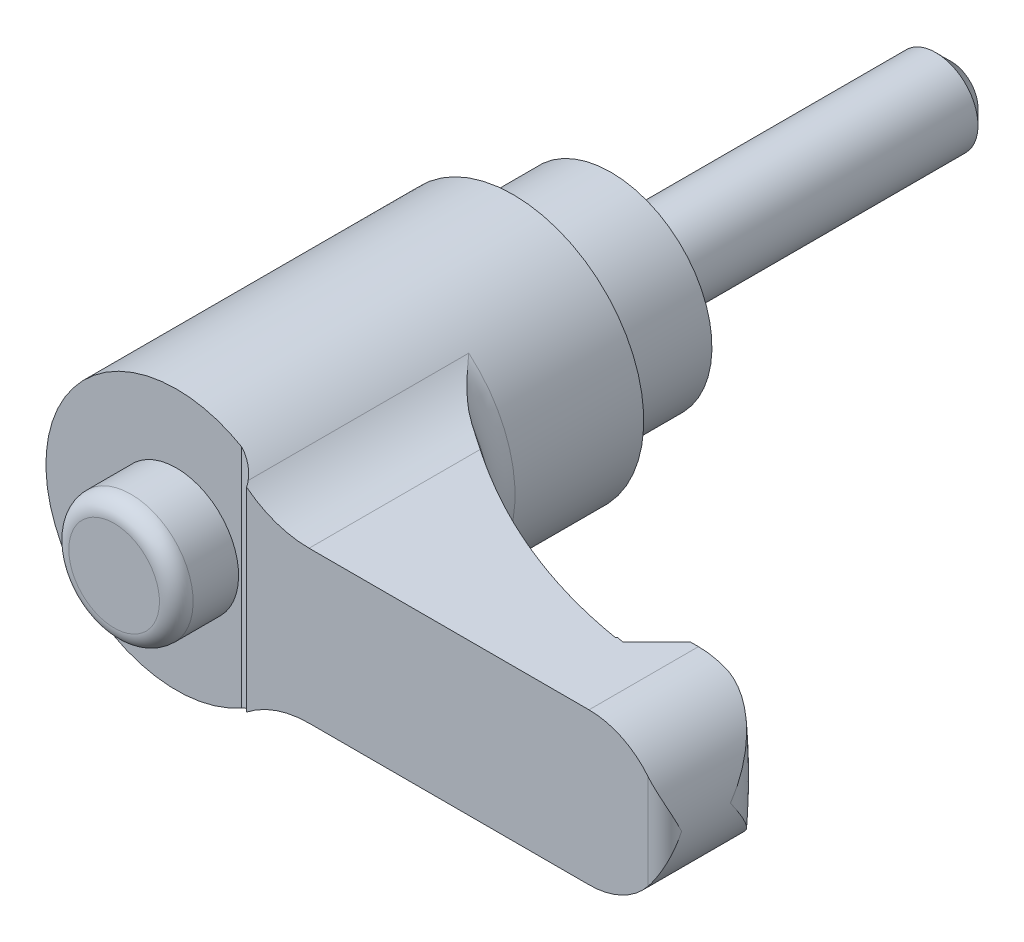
ISO-10303-21;
HEADER;
FILE_DESCRIPTION(('STEP AP214'),'2;1');
FILE_NAME('part.step','',(''),(''),'','','');
FILE_SCHEMA(('AUTOMOTIVE_DESIGN { 1 0 10303 214 1 1 1 1 }'));
ENDSEC;
DATA;
#1=APPLICATION_CONTEXT('core data for automotive mechanical design processes');
#2=APPLICATION_PROTOCOL_DEFINITION('international standard','automotive_design',2000,#1);
#3=PRODUCT_CONTEXT('',#1,'mechanical');
#4=PRODUCT('Part','Part','',(#3));
#5=PRODUCT_RELATED_PRODUCT_CATEGORY('part','',(#4));
#6=PRODUCT_DEFINITION_FORMATION('','',#4);
#7=PRODUCT_DEFINITION_CONTEXT('part definition',#1,'design');
#8=PRODUCT_DEFINITION('design','',#6,#7);
#9=PRODUCT_DEFINITION_SHAPE('','',#8);
#10=(LENGTH_UNIT() NAMED_UNIT(*) SI_UNIT(.MILLI.,.METRE.));
#11=(NAMED_UNIT(*) PLANE_ANGLE_UNIT() SI_UNIT($,.RADIAN.));
#12=(NAMED_UNIT(*) SI_UNIT($,.STERADIAN.) SOLID_ANGLE_UNIT());
#13=UNCERTAINTY_MEASURE_WITH_UNIT(LENGTH_MEASURE(1.E-05),#10,'distance_accuracy_value','');
#14=(GEOMETRIC_REPRESENTATION_CONTEXT(3) GLOBAL_UNCERTAINTY_ASSIGNED_CONTEXT((#13)) GLOBAL_UNIT_ASSIGNED_CONTEXT((#10,
#11,#12)) REPRESENTATION_CONTEXT('',''));
#15=CARTESIAN_POINT('',(0.,0.,0.));
#16=DIRECTION('',(0.,0.,1.));
#17=DIRECTION('',(1.,0.,0.));
#18=AXIS2_PLACEMENT_3D('',#15,#16,#17);
#19=CARTESIAN_POINT('',(4.8,0.,0.));
#20=DIRECTION('',(0.,0.,1.));
#21=DIRECTION('',(0.,-1.,0.));
#22=AXIS2_PLACEMENT_3D('',#19,#20,#21);
#23=PLANE('',#22);
#24=CARTESIAN_POINT('',(0.,0.,0.));
#25=DIRECTION('',(0.,0.,-1.));
#26=DIRECTION('',(0.,1.,0.));
#27=AXIS2_PLACEMENT_3D('',#24,#25,#26);
#28=CIRCLE('',#27,2.5);
#29=CARTESIAN_POINT('',(0.,2.5,0.));
#30=VERTEX_POINT('',#29);
#31=EDGE_CURVE('E493',#30,#30,#28,.T.);
#32=ORIENTED_EDGE('',*,*,#31,.F.);
#33=EDGE_LOOP('',(#32));
#34=FACE_BOUND('',#33,.T.);
#35=CARTESIAN_POINT('',(0.,0.,0.));
#36=DIRECTION('',(0.,0.,-1.));
#37=DIRECTION('',(0.,1.,0.));
#38=AXIS2_PLACEMENT_3D('',#35,#36,#37);
#39=CIRCLE('',#38,4.8);
#40=CARTESIAN_POINT('',(0.,4.8,0.));
#41=VERTEX_POINT('',#40);
#42=EDGE_CURVE('E433',#41,#41,#39,.T.);
#43=ORIENTED_EDGE('',*,*,#42,.T.);
#44=EDGE_LOOP('',(#43));
#45=FACE_BOUND('',#44,.T.);
#46=ADVANCED_FACE('F14',(#34,#45),#23,.F.);
#47=CARTESIAN_POINT('',(0.,0.,26.));
#48=DIRECTION('',(0.,0.,-1.));
#49=DIRECTION('',(0.,1.,0.));
#50=AXIS2_PLACEMENT_3D('',#47,#48,#49);
#51=PLANE('',#50);
#52=CARTESIAN_POINT('',(0.,0.,26.));
#53=DIRECTION('',(0.,0.,-1.));
#54=DIRECTION('',(0.,1.,0.));
#55=AXIS2_PLACEMENT_3D('',#52,#53,#54);
#56=CIRCLE('',#55,7.75);
#57=CARTESIAN_POINT('',(3.875,-6.7116968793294,26.));
#58=VERTEX_POINT('',#57);
#59=CARTESIAN_POINT('',(3.875,6.7116968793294,26.));
#60=VERTEX_POINT('',#59);
#61=EDGE_CURVE('E380',#58,#60,#56,.T.);
#62=ORIENTED_EDGE('',*,*,#61,.F.);
#63=DIRECTION('',(0.,1.,0.));
#64=VECTOR('',#63,1.);
#65=CARTESIAN_POINT('',(3.875,-9.,26.));
#66=LINE('',#65,#64);
#67=EDGE_CURVE('E467',#58,#60,#66,.T.);
#68=ORIENTED_EDGE('',*,*,#67,.T.);
#69=EDGE_LOOP('',(#62,#68));
#70=FACE_BOUND('',#69,.T.);
#71=CARTESIAN_POINT('',(0.,0.,26.));
#72=DIRECTION('',(0.,0.,-1.));
#73=DIRECTION('',(0.,1.,0.));
#74=AXIS2_PLACEMENT_3D('',#71,#72,#73);
#75=CIRCLE('',#74,3.69047619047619);
#76=CARTESIAN_POINT('',(0.,3.69047619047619,26.));
#77=VERTEX_POINT('',#76);
#78=EDGE_CURVE('E188',#77,#77,#75,.F.);
#79=ORIENTED_EDGE('',*,*,#78,.F.);
#80=EDGE_LOOP('',(#79));
#81=FACE_BOUND('',#80,.T.);
#82=ADVANCED_FACE('F163',(#70,#81),#51,.F.);
#83=CARTESIAN_POINT('',(25.5,0.,0.));
#84=DIRECTION('',(0.,0.,1.));
#85=DIRECTION('',(0.,-1.,0.));
#86=AXIS2_PLACEMENT_3D('',#83,#84,#85);
#87=CYLINDRICAL_SURFACE('',#86,4.5);
#88=CARTESIAN_POINT('',(30.,0.,23.1));
#89=CARTESIAN_POINT('',(30.0000000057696,-0.00397224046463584,23.0972162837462));
#90=CARTESIAN_POINT('',(29.9999947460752,-0.00794462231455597,23.0944324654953));
#91=CARTESIAN_POINT('',(29.9991779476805,-0.316207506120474,22.8784039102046));
#92=CARTESIAN_POINT('',(29.967472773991,-0.621260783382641,22.6646232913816));
#93=CARTESIAN_POINT('',(29.8729566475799,-1.07288244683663,22.3499400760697));
#94=CARTESIAN_POINT('',(29.8335087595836,-1.2227001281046,22.2458576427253));
#95=CARTESIAN_POINT('',(29.7386099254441,-1.51933949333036,22.0407893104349));
#96=CARTESIAN_POINT('',(29.6831664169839,-1.6661625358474,21.9398019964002));
#97=CARTESIAN_POINT('',(29.5225221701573,-2.0316181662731,21.690355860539));
#98=CARTESIAN_POINT('',(29.4064726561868,-2.24755940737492,21.5447545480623));
#99=CARTESIAN_POINT('',(29.1349908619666,-2.66429651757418,21.2699985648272));
#100=CARTESIAN_POINT('',(28.9796468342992,-2.86512503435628,21.1408080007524));
#101=CARTESIAN_POINT('',(28.6740094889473,-3.19567948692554,20.9378778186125));
#102=CARTESIAN_POINT('',(28.5328529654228,-3.3303385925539,20.8584463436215));
#103=CARTESIAN_POINT('',(28.2285136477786,-3.58389708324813,20.7186599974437));
#104=CARTESIAN_POINT('',(28.0653563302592,-3.70281438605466,20.6582833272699));
#105=CARTESIAN_POINT('',(27.7569268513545,-3.89637158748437,20.5739705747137));
#106=CARTESIAN_POINT('',(27.6155988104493,-3.97499958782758,20.5449430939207));
#107=CARTESIAN_POINT('',(27.3962983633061,-4.08175109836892,20.516319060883));
#108=CARTESIAN_POINT('',(27.3219652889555,-4.11547521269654,20.5092639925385));
#109=CARTESIAN_POINT('',(27.1713145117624,-4.17892025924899,20.5006475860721));
#110=CARTESIAN_POINT('',(27.0949977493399,-4.20864304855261,20.4990836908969));
#111=CARTESIAN_POINT('',(26.940135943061,-4.26413478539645,20.5019689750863));
#112=CARTESIAN_POINT('',(26.8615759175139,-4.28985895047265,20.5064814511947));
#113=CARTESIAN_POINT('',(26.7037978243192,-4.33677756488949,20.5220962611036));
#114=CARTESIAN_POINT('',(26.624580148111,-4.35797453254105,20.5331949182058));
#115=CARTESIAN_POINT('',(26.4663684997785,-4.39576374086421,20.5623470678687));
#116=CARTESIAN_POINT('',(26.3873744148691,-4.41235899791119,20.5803959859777));
#117=CARTESIAN_POINT('',(26.230581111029,-4.44101436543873,20.6236628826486));
#118=CARTESIAN_POINT('',(26.1527814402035,-4.4530762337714,20.6488780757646));
#119=CARTESIAN_POINT('',(25.9747863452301,-4.47604389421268,20.7158088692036));
#120=CARTESIAN_POINT('',(25.8753706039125,-4.48535121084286,20.7602222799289));
#121=CARTESIAN_POINT('',(25.7308199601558,-4.4943380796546,20.836059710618));
#122=CARTESIAN_POINT('',(25.6833620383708,-4.49650441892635,20.8629005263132));
#123=CARTESIAN_POINT('',(25.5902043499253,-4.4993369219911,20.9195771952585));
#124=CARTESIAN_POINT('',(25.5445050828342,-4.50000266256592,20.9494138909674));
#125=CARTESIAN_POINT('',(25.4998,-4.49999999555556,20.980704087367));
#126=B_SPLINE_CURVE_WITH_KNOTS('',3,(#88,#89,#90,#91,#92,#93,#94,#95,#96,#97,#98,#99,#100,#101,
#102,#103,#104,#105,#106,#107,#108,#109,#110,#111,#112,#113,#114,#115,#116,#117,#118,#119,#120,
#121,#122,#123,#124,#125),.UNSPECIFIED.,.F.,.F.,(4,2,2,2,2,2,2,2,2,2,2,2,2,2,2,2,2,2,4),(0.,
0.0145521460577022,1.12923174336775,1.68863416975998,2.24777690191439,3.0999476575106,
3.95022123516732,4.58000022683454,5.20905610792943,5.69992949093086,5.94545977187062,
6.19087570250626,6.43886797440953,6.68672193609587,6.93441304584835,7.18200801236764,
7.50864895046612,7.67223429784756,7.83586577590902),.UNSPECIFIED.);
#127=CARTESIAN_POINT('',(27.0737254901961,-4.21584962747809,20.5));
#128=VERTEX_POINT('',#127);
#129=CARTESIAN_POINT('',(30.,0.,23.1));
#130=VERTEX_POINT('',#129);
#131=EDGE_CURVE('E133',#128,#130,#126,.F.);
#132=ORIENTED_EDGE('',*,*,#131,.T.);
#133=CARTESIAN_POINT('',(30.,0.,23.1));
#134=CARTESIAN_POINT('',(30.0000000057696,0.00397224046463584,23.0972162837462));
#135=CARTESIAN_POINT('',(29.9999947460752,0.00794462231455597,23.0944324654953));
#136=CARTESIAN_POINT('',(29.9991779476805,0.316207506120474,22.8784039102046));
#137=CARTESIAN_POINT('',(29.967472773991,0.621260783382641,22.6646232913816));
#138=CARTESIAN_POINT('',(29.8729566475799,1.07288244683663,22.3499400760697));
#139=CARTESIAN_POINT('',(29.8335087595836,1.2227001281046,22.2458576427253));
#140=CARTESIAN_POINT('',(29.7386099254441,1.51933949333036,22.0407893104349));
#141=CARTESIAN_POINT('',(29.6831664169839,1.6661625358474,21.9398019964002));
#142=CARTESIAN_POINT('',(29.5225221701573,2.0316181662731,21.690355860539));
#143=CARTESIAN_POINT('',(29.4064726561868,2.24755940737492,21.5447545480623));
#144=CARTESIAN_POINT('',(29.1349908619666,2.66429651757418,21.2699985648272));
#145=CARTESIAN_POINT('',(28.9796468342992,2.86512503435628,21.1408080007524));
#146=CARTESIAN_POINT('',(28.6740094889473,3.19567948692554,20.9378778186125));
#147=CARTESIAN_POINT('',(28.5328529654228,3.3303385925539,20.8584463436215));
#148=CARTESIAN_POINT('',(28.2285136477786,3.58389708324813,20.7186599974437));
#149=CARTESIAN_POINT('',(28.0653563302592,3.70281438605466,20.6582833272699));
#150=CARTESIAN_POINT('',(27.7569268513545,3.89637158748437,20.5739705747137));
#151=CARTESIAN_POINT('',(27.6155988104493,3.97499958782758,20.5449430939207));
#152=CARTESIAN_POINT('',(27.3962983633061,4.08175109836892,20.516319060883));
#153=CARTESIAN_POINT('',(27.3219652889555,4.11547521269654,20.5092639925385));
#154=CARTESIAN_POINT('',(27.1713145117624,4.17892025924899,20.5006475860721));
#155=CARTESIAN_POINT('',(27.0949977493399,4.20864304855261,20.4990836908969));
#156=CARTESIAN_POINT('',(26.940135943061,4.26413478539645,20.5019689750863));
#157=CARTESIAN_POINT('',(26.8615759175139,4.28985895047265,20.5064814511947));
#158=CARTESIAN_POINT('',(26.7037978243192,4.33677756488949,20.5220962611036));
#159=CARTESIAN_POINT('',(26.624580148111,4.35797453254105,20.5331949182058));
#160=CARTESIAN_POINT('',(26.4663684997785,4.39576374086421,20.5623470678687));
#161=CARTESIAN_POINT('',(26.3873744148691,4.41235899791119,20.5803959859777));
#162=CARTESIAN_POINT('',(26.230581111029,4.44101436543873,20.6236628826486));
#163=CARTESIAN_POINT('',(26.1527814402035,4.4530762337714,20.6488780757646));
#164=CARTESIAN_POINT('',(25.9747863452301,4.47604389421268,20.7158088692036));
#165=CARTESIAN_POINT('',(25.8753706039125,4.48535121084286,20.7602222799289));
#166=CARTESIAN_POINT('',(25.7308199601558,4.4943380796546,20.836059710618));
#167=CARTESIAN_POINT('',(25.6833620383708,4.49650441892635,20.8629005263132));
#168=CARTESIAN_POINT('',(25.5902043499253,4.4993369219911,20.9195771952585));
#169=CARTESIAN_POINT('',(25.5445050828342,4.50000266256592,20.9494138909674));
#170=CARTESIAN_POINT('',(25.4998,4.49999999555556,20.980704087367));
#171=B_SPLINE_CURVE_WITH_KNOTS('',3,(#133,#134,#135,#136,#137,#138,#139,#140,#141,#142,#143,
#144,#145,#146,#147,#148,#149,#150,#151,#152,#153,#154,#155,#156,#157,#158,#159,#160,#161,#162,
#163,#164,#165,#166,#167,#168,#169,#170),.UNSPECIFIED.,.F.,.F.,(4,2,2,2,2,2,2,2,2,2,2,2,2,2,2,2,
2,2,4),(0.,0.0145521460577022,1.12923174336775,1.68863416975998,2.24777690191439,
3.0999476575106,3.95022123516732,4.58000022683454,5.20905610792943,5.69992949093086,
5.94545977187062,6.19087570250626,6.43886797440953,6.68672193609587,6.93441304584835,
7.18200801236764,7.50864895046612,7.67223429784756,7.83586577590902),.UNSPECIFIED.);
#172=CARTESIAN_POINT('',(27.0737254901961,4.21584962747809,20.5));
#173=VERTEX_POINT('',#172);
#174=EDGE_CURVE('E130',#130,#173,#171,.T.);
#175=ORIENTED_EDGE('',*,*,#174,.T.);
#176=CARTESIAN_POINT('',(25.5,0.,20.5));
#177=DIRECTION('',(0.,0.,-1.));
#178=DIRECTION('',(0.,1.,0.));
#179=AXIS2_PLACEMENT_3D('',#176,#177,#178);
#180=CIRCLE('',#179,4.5);
#181=CARTESIAN_POINT('',(25.5,4.5,20.5));
#182=VERTEX_POINT('',#181);
#183=EDGE_CURVE('E405',#173,#182,#180,.F.);
#184=ORIENTED_EDGE('',*,*,#183,.T.);
#185=DIRECTION('',(0.,0.,1.));
#186=VECTOR('',#185,1.);
#187=CARTESIAN_POINT('',(25.5,4.5,0.));
#188=LINE('',#187,#186);
#189=CARTESIAN_POINT('',(25.5,4.5,27.));
#190=VERTEX_POINT('',#189);
#191=EDGE_CURVE('E404',#182,#190,#188,.T.);
#192=ORIENTED_EDGE('',*,*,#191,.T.);
#193=CARTESIAN_POINT('',(25.5,0.,27.));
#194=DIRECTION('',(0.,0.,1.));
#195=DIRECTION('',(0.,-1.,0.));
#196=AXIS2_PLACEMENT_3D('',#193,#194,#195);
#197=CIRCLE('',#196,4.5);
#198=CARTESIAN_POINT('',(29.,2.82842712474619,27.));
#199=VERTEX_POINT('',#198);
#200=EDGE_CURVE('E383',#199,#190,#197,.T.);
#201=ORIENTED_EDGE('',*,*,#200,.F.);
#202=CARTESIAN_POINT('',(29.,2.82842712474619,27.));
#203=CARTESIAN_POINT('',(29.0452569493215,2.77244060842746,26.9999705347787));
#204=CARTESIAN_POINT('',(29.08910814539,2.71541373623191,26.9969310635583));
#205=CARTESIAN_POINT('',(29.1737346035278,2.59976408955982,26.9857221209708));
#206=CARTESIAN_POINT('',(29.2145155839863,2.54114457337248,26.9775624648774));
#207=CARTESIAN_POINT('',(29.2926216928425,2.42301598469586,26.9570723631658));
#208=CARTESIAN_POINT('',(29.3299701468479,2.36351669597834,26.9447732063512));
#209=CARTESIAN_POINT('',(29.4015263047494,2.24343051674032,26.9166544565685));
#210=CARTESIAN_POINT('',(29.4357319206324,2.18284293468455,26.9008325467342));
#211=CARTESIAN_POINT('',(29.5205149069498,2.0242761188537,26.8558925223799));
#212=CARTESIAN_POINT('',(29.5686353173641,1.92562477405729,26.8244847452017));
#213=CARTESIAN_POINT('',(29.6569408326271,1.7267576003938,26.7560098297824));
#214=CARTESIAN_POINT('',(29.6971228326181,1.62654117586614,26.7189404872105));
#215=CARTESIAN_POINT('',(29.769924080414,1.42454335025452,26.6403878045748));
#216=CARTESIAN_POINT('',(29.8025090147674,1.32275698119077,26.5988856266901));
#217=CARTESIAN_POINT('',(29.8600923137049,1.1184186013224,26.5127603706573));
#218=CARTESIAN_POINT('',(29.8850925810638,1.0158667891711,26.4681380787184));
#219=CARTESIAN_POINT('',(29.9373931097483,0.763467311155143,26.3559210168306));
#220=CARTESIAN_POINT('',(29.9605764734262,0.613303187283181,26.2871011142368));
#221=CARTESIAN_POINT('',(29.9916507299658,0.312779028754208,26.1474204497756));
#222=CARTESIAN_POINT('',(29.999578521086,0.162420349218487,26.0765650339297));
#223=CARTESIAN_POINT('',(29.9999945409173,0.00809034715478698,26.0038138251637));
#224=CARTESIAN_POINT('',(29.999999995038,0.00404514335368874,26.0019068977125));
#225=CARTESIAN_POINT('',(30.,0.,26.));
#226=B_SPLINE_CURVE_WITH_KNOTS('',3,(#202,#203,#204,#205,#206,#207,#208,#209,#210,#211,#212,
#213,#214,#215,#216,#217,#218,#219,#220,#221,#222,#223,#224,#225),.UNSPECIFIED.,.F.,.F.,(4,2,2,
2,2,2,2,2,2,2,2,4),(0.,0.215782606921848,0.431152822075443,0.644930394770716,0.858848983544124,
1.20082332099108,1.5429311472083,1.88655545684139,2.23009348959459,2.7297347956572,
3.22816610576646,3.2415825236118),.UNSPECIFIED.);
#227=CARTESIAN_POINT('',(30.,0.,26.));
#228=VERTEX_POINT('',#227);
#229=EDGE_CURVE('E174',#228,#199,#226,.F.);
#230=ORIENTED_EDGE('',*,*,#229,.F.);
#231=CARTESIAN_POINT('',(29.,-2.82842712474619,27.));
#232=CARTESIAN_POINT('',(29.0452569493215,-2.77244060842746,26.9999705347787));
#233=CARTESIAN_POINT('',(29.08910814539,-2.71541373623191,26.9969310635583));
#234=CARTESIAN_POINT('',(29.1737346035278,-2.59976408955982,26.9857221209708));
#235=CARTESIAN_POINT('',(29.2145155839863,-2.54114457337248,26.9775624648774));
#236=CARTESIAN_POINT('',(29.2926216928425,-2.42301598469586,26.9570723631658));
#237=CARTESIAN_POINT('',(29.3299701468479,-2.36351669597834,26.9447732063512));
#238=CARTESIAN_POINT('',(29.4015263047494,-2.24343051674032,26.9166544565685));
#239=CARTESIAN_POINT('',(29.4357319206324,-2.18284293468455,26.9008325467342));
#240=CARTESIAN_POINT('',(29.5205149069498,-2.0242761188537,26.8558925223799));
#241=CARTESIAN_POINT('',(29.5686353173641,-1.92562477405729,26.8244847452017));
#242=CARTESIAN_POINT('',(29.6569408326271,-1.7267576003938,26.7560098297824));
#243=CARTESIAN_POINT('',(29.6971228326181,-1.62654117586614,26.7189404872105));
#244=CARTESIAN_POINT('',(29.769924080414,-1.42454335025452,26.6403878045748));
#245=CARTESIAN_POINT('',(29.8025090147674,-1.32275698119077,26.5988856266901));
#246=CARTESIAN_POINT('',(29.8600923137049,-1.1184186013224,26.5127603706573));
#247=CARTESIAN_POINT('',(29.8850925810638,-1.0158667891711,26.4681380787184));
#248=CARTESIAN_POINT('',(29.9373931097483,-0.763467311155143,26.3559210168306));
#249=CARTESIAN_POINT('',(29.9605764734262,-0.613303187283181,26.2871011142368));
#250=CARTESIAN_POINT('',(29.9916507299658,-0.312779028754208,26.1474204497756));
#251=CARTESIAN_POINT('',(29.999578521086,-0.162420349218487,26.0765650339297));
#252=CARTESIAN_POINT('',(29.9999945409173,-0.00809034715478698,26.0038138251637));
#253=CARTESIAN_POINT('',(29.999999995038,-0.00404514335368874,26.0019068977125));
#254=CARTESIAN_POINT('',(30.,0.,26.));
#255=B_SPLINE_CURVE_WITH_KNOTS('',3,(#231,#232,#233,#234,#235,#236,#237,#238,#239,#240,#241,
#242,#243,#244,#245,#246,#247,#248,#249,#250,#251,#252,#253,#254),.UNSPECIFIED.,.F.,.F.,(4,2,2,
2,2,2,2,2,2,2,2,4),(0.,0.215782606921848,0.431152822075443,0.644930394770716,0.858848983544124,
1.20082332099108,1.5429311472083,1.88655545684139,2.23009348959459,2.7297347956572,
3.22816610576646,3.2415825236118),.UNSPECIFIED.);
#256=CARTESIAN_POINT('',(29.,-2.82842712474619,27.));
#257=VERTEX_POINT('',#256);
#258=EDGE_CURVE('E182',#257,#228,#255,.T.);
#259=ORIENTED_EDGE('',*,*,#258,.F.);
#260=CARTESIAN_POINT('',(25.5,-4.5,27.));
#261=VERTEX_POINT('',#260);
#262=EDGE_CURVE('E389',#261,#257,#197,.T.);
#263=ORIENTED_EDGE('',*,*,#262,.F.);
#264=DIRECTION('',(0.,0.,1.));
#265=VECTOR('',#264,1.);
#266=CARTESIAN_POINT('',(25.5,-4.5,0.));
#267=LINE('',#266,#265);
#268=CARTESIAN_POINT('',(25.5,-4.5,20.5));
#269=VERTEX_POINT('',#268);
#270=EDGE_CURVE('E409',#269,#261,#267,.T.);
#271=ORIENTED_EDGE('',*,*,#270,.F.);
#272=EDGE_CURVE('E140',#269,#128,#180,.F.);
#273=ORIENTED_EDGE('',*,*,#272,.T.);
#274=EDGE_LOOP('',(#132,#175,#184,#192,#201,#230,#259,#263,#271,#273));
#275=FACE_BOUND('',#274,.T.);
#276=ADVANCED_FACE('F138',(#275),#87,.T.);
#277=CARTESIAN_POINT('',(28.072410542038,-9.,-7.06806810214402));
#278=DIRECTION('',(0.,1.,0.));
#279=DIRECTION('',(-1.,0.,0.));
#280=AXIS2_PLACEMENT_3D('',#277,#278,#279);
#281=CYLINDRICAL_SURFACE('',#280,30.);
#282=CARTESIAN_POINT('',(22.457864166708,5.40076351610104,22.4018635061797));
#283=CARTESIAN_POINT('',(22.5328704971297,5.02783315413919,22.4161416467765));
#284=CARTESIAN_POINT('',(22.6003478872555,4.65331694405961,22.4287120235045));
#285=CARTESIAN_POINT('',(22.7199001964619,3.90172149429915,22.4506465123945));
#286=CARTESIAN_POINT('',(22.7719742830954,3.52464211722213,22.4600104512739));
#287=CARTESIAN_POINT('',(22.860391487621,2.76836181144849,22.4757441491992));
#288=CARTESIAN_POINT('',(22.8967259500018,2.38915983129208,22.4821122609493));
#289=CARTESIAN_POINT('',(22.953399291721,1.62955869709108,22.4919810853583));
#290=CARTESIAN_POINT('',(22.9737386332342,1.24915957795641,22.4954818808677));
#291=CARTESIAN_POINT('',(23.0101209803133,0.119914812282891,22.5017516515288));
#292=CARTESIAN_POINT('',(23.0030278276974,-0.62982701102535,22.5005458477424));
#293=CARTESIAN_POINT('',(22.9265280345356,-2.12549757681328,22.487326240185));
#294=CARTESIAN_POINT('',(22.8571649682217,-2.87142861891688,22.4753199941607));
#295=CARTESIAN_POINT('',(22.717445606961,-3.91200869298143,22.450161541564));
#296=CARTESIAN_POINT('',(22.6723784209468,-4.21035002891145,22.4419679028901));
#297=CARTESIAN_POINT('',(22.5724363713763,-4.80637536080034,22.4235048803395));
#298=CARTESIAN_POINT('',(22.5175283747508,-5.10405358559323,22.4132284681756));
#299=CARTESIAN_POINT('',(22.457864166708,-5.40076351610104,22.4018635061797));
#300=B_SPLINE_CURVE_WITH_KNOTS('',3,(#282,#283,#284,#285,#286,#287,#288,#289,#290,#291,#292,
#293,#294,#295,#296,#297,#298,#299),.UNSPECIFIED.,.F.,.F.,(4,2,2,2,2,2,2,2,4),(0.,
1.14192528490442,2.28391227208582,3.4265264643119,4.56910763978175,6.81558260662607,
9.06048679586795,9.96586555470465,10.8743519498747),.UNSPECIFIED.);
#301=CARTESIAN_POINT('',(23.,0.,22.5));
#302=VERTEX_POINT('',#301);
#303=CARTESIAN_POINT('',(22.6238084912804,-4.5,22.4329951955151));
#304=VERTEX_POINT('',#303);
#305=EDGE_CURVE('E136',#302,#304,#300,.T.);
#306=ORIENTED_EDGE('',*,*,#305,.F.);
#307=DIRECTION('',(0.,1.,0.));
#308=VECTOR('',#307,1.);
#309=CARTESIAN_POINT('',(23.,-9.,22.5));
#310=LINE('',#309,#308);
#311=CARTESIAN_POINT('',(23.,-4.5,22.5));
#312=VERTEX_POINT('',#311);
#313=EDGE_CURVE('E473',#312,#302,#310,.T.);
#314=ORIENTED_EDGE('',*,*,#313,.F.);
#315=CARTESIAN_POINT('',(28.072410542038,-4.5,-7.06806810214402));
#316=DIRECTION('',(0.,1.,0.));
#317=DIRECTION('',(-1.,0.,0.));
#318=AXIS2_PLACEMENT_3D('',#315,#316,#317);
#319=CIRCLE('',#318,30.);
#320=EDGE_CURVE('E464',#312,#304,#319,.F.);
#321=ORIENTED_EDGE('',*,*,#320,.T.);
#322=EDGE_LOOP('',(#306,#314,#321));
#323=FACE_BOUND('',#322,.T.);
#324=ADVANCED_FACE('F162',(#323),#281,.F.);
#325=CARTESIAN_POINT('',(27.4,-9.,20.5));
#326=DIRECTION('',(0.,0.,-1.));
#327=DIRECTION('',(0.,1.,0.));
#328=AXIS2_PLACEMENT_3D('',#325,#326,#327);
#329=PLANE('',#328);
#330=ORIENTED_EDGE('',*,*,#183,.F.);
#331=CARTESIAN_POINT('',(0.,0.,20.5));
#332=DIRECTION('',(0.,0.,-1.));
#333=DIRECTION('',(0.,1.,0.));
#334=AXIS2_PLACEMENT_3D('',#331,#332,#333);
#335=CIRCLE('',#334,27.4);
#336=EDGE_CURVE('E37',#173,#128,#335,.T.);
#337=ORIENTED_EDGE('',*,*,#336,.T.);
#338=ORIENTED_EDGE('',*,*,#272,.F.);
#339=DIRECTION('',(-1.,0.,0.));
#340=VECTOR('',#339,1.);
#341=CARTESIAN_POINT('',(25.5,-4.5,20.5));
#342=LINE('',#341,#340);
#343=CARTESIAN_POINT('',(25.,-4.5,20.5));
#344=VERTEX_POINT('',#343);
#345=EDGE_CURVE('E540',#269,#344,#342,.T.);
#346=ORIENTED_EDGE('',*,*,#345,.T.);
#347=DIRECTION('',(0.,1.,0.));
#348=VECTOR('',#347,1.);
#349=CARTESIAN_POINT('',(25.,-9.,20.5));
#350=LINE('',#349,#348);
#351=CARTESIAN_POINT('',(25.,4.5,20.5));
#352=VERTEX_POINT('',#351);
#353=EDGE_CURVE('E460',#344,#352,#350,.T.);
#354=ORIENTED_EDGE('',*,*,#353,.T.);
#355=DIRECTION('',(1.,0.,0.));
#356=VECTOR('',#355,1.);
#357=CARTESIAN_POINT('',(8.87764045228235,4.5,20.5));
#358=LINE('',#357,#356);
#359=EDGE_CURVE('E419',#352,#182,#358,.T.);
#360=ORIENTED_EDGE('',*,*,#359,.T.);
#361=EDGE_LOOP('',(#330,#337,#338,#346,#354,#360));
#362=FACE_BOUND('',#361,.T.);
#363=ADVANCED_FACE('F196',(#362),#329,.T.);
#364=CARTESIAN_POINT('',(0.,0.,27.));
#365=DIRECTION('',(0.,0.,1.));
#366=DIRECTION('',(0.,-1.,0.));
#367=AXIS2_PLACEMENT_3D('',#364,#365,#366);
#368=PLANE('',#367);
#369=CARTESIAN_POINT('',(8.87764045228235,10.5,27.));
#370=DIRECTION('',(0.,0.,1.));
#371=DIRECTION('',(1.,0.,0.));
#372=AXIS2_PLACEMENT_3D('',#369,#370,#371);
#373=CIRCLE('',#372,6.);
#374=CARTESIAN_POINT('',(5.16666666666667,5.78527057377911,27.));
#375=VERTEX_POINT('',#374);
#376=CARTESIAN_POINT('',(8.87764045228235,4.5,27.));
#377=VERTEX_POINT('',#376);
#378=EDGE_CURVE('E414',#375,#377,#373,.T.);
#379=ORIENTED_EDGE('',*,*,#378,.F.);
#380=DIRECTION('',(0.,1.,0.));
#381=VECTOR('',#380,1.);
#382=CARTESIAN_POINT('',(5.16666666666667,-9.,27.));
#383=LINE('',#382,#381);
#384=CARTESIAN_POINT('',(5.16666666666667,-5.78527057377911,27.));
#385=VERTEX_POINT('',#384);
#386=EDGE_CURVE('E453',#385,#375,#383,.T.);
#387=ORIENTED_EDGE('',*,*,#386,.F.);
#388=CARTESIAN_POINT('',(8.87764045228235,-10.5,27.));
#389=DIRECTION('',(0.,0.,1.));
#390=DIRECTION('',(1.,0.,0.));
#391=AXIS2_PLACEMENT_3D('',#388,#389,#390);
#392=CIRCLE('',#391,6.);
#393=CARTESIAN_POINT('',(8.87764045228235,-4.5,27.));
#394=VERTEX_POINT('',#393);
#395=EDGE_CURVE('E417',#394,#385,#392,.T.);
#396=ORIENTED_EDGE('',*,*,#395,.F.);
#397=DIRECTION('',(-1.,0.,0.));
#398=VECTOR('',#397,1.);
#399=CARTESIAN_POINT('',(25.5,-4.5,27.));
#400=LINE('',#399,#398);
#401=EDGE_CURVE('E413',#261,#394,#400,.T.);
#402=ORIENTED_EDGE('',*,*,#401,.F.);
#403=ORIENTED_EDGE('',*,*,#262,.T.);
#404=DIRECTION('',(0.,1.,0.));
#405=VECTOR('',#404,1.);
#406=CARTESIAN_POINT('',(29.,-9.,27.));
#407=LINE('',#406,#405);
#408=EDGE_CURVE('E401',#257,#199,#407,.T.);
#409=ORIENTED_EDGE('',*,*,#408,.T.);
#410=ORIENTED_EDGE('',*,*,#200,.T.);
#411=DIRECTION('',(1.,0.,0.));
#412=VECTOR('',#411,1.);
#413=CARTESIAN_POINT('',(8.87764045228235,4.5,27.));
#414=LINE('',#413,#412);
#415=EDGE_CURVE('E400',#377,#190,#414,.T.);
#416=ORIENTED_EDGE('',*,*,#415,.F.);
#417=EDGE_LOOP('',(#379,#387,#396,#402,#403,#409,#410,#416));
#418=FACE_BOUND('',#417,.T.);
#419=ADVANCED_FACE('F244',(#418),#368,.T.);
#420=CARTESIAN_POINT('',(0.,0.,0.));
#421=DIRECTION('',(0.,0.,-1.));
#422=DIRECTION('',(0.,1.,0.));
#423=AXIS2_PLACEMENT_3D('',#420,#421,#422);
#424=CYLINDRICAL_SURFACE('',#423,7.75);
#425=CARTESIAN_POINT('',(0.,0.,13.6426560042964));
#426=DIRECTION('',(0.,0.,-1.));
#427=DIRECTION('',(0.,1.,0.));
#428=AXIS2_PLACEMENT_3D('',#425,#426,#427);
#429=CIRCLE('',#428,7.75);
#430=CARTESIAN_POINT('',(5.00376098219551,5.91818181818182,13.6426560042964));
#431=VERTEX_POINT('',#430);
#432=CARTESIAN_POINT('',(5.00376098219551,-5.91818181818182,13.6426560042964));
#433=VERTEX_POINT('',#432);
#434=EDGE_CURVE('E374',#431,#433,#429,.T.);
#435=ORIENTED_EDGE('',*,*,#434,.T.);
#436=DIRECTION('',(0.,0.,1.));
#437=VECTOR('',#436,1.);
#438=CARTESIAN_POINT('',(5.00376098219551,-5.91818181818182,0.));
#439=LINE('',#438,#437);
#440=CARTESIAN_POINT('',(5.00376098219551,-5.91818181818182,26.7442638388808));
#441=VERTEX_POINT('',#440);
#442=EDGE_CURVE('E425',#433,#441,#439,.T.);
#443=ORIENTED_EDGE('',*,*,#442,.T.);
#444=CARTESIAN_POINT('',(3.875,-6.7116968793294,26.));
#445=CARTESIAN_POINT('',(3.9487248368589,-6.66914880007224,26.0179048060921));
#446=CARTESIAN_POINT('',(4.02097408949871,-6.62579988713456,26.039874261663));
#447=CARTESIAN_POINT('',(4.16199829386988,-6.53812669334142,26.0915573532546));
#448=CARTESIAN_POINT('',(4.23077434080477,-6.49380272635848,26.1212685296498));
#449=CARTESIAN_POINT('',(4.36202505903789,-6.40634475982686,26.1868862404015));
#450=CARTESIAN_POINT('',(4.42463632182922,-6.36322379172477,26.2225378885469));
#451=CARTESIAN_POINT('',(4.54579687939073,-6.27724013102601,26.3004737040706));
#452=CARTESIAN_POINT('',(4.60434578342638,-6.23437746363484,26.3427585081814));
#453=CARTESIAN_POINT('',(4.71026264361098,-6.1546555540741,26.4283893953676));
#454=CARTESIAN_POINT('',(4.75813291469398,-6.11768751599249,26.4710140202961));
#455=CARTESIAN_POINT('',(4.8500303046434,-6.04509175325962,26.56120031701));
#456=CARTESIAN_POINT('',(4.89405965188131,-6.00946325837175,26.6087590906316));
#457=CARTESIAN_POINT('',(4.97925799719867,-5.9390764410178,26.7103994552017));
#458=CARTESIAN_POINT('',(5.02029084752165,-5.90438218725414,26.7646407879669));
#459=CARTESIAN_POINT('',(5.09738332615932,-5.83796295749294,26.8783962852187));
#460=CARTESIAN_POINT('',(5.13343386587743,-5.80624344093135,26.9379197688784));
#461=CARTESIAN_POINT('',(5.16666666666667,-5.77650894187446,27.));
#462=B_SPLINE_CURVE_WITH_KNOTS('',3,(#444,#445,#446,#447,#448,#449,#450,#451,#452,#453,#454,
#455,#456,#457,#458,#459,#460,#461),.UNSPECIFIED.,.F.,.F.,(4,2,2,2,2,2,2,2,4),(0.,
0.260811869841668,0.521540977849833,0.773092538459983,1.02466826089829,1.24638864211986,
1.4679795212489,1.69664297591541,1.92571819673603),.UNSPECIFIED.);
#463=EDGE_CURVE('E218',#58,#441,#462,.T.);
#464=ORIENTED_EDGE('',*,*,#463,.F.);
#465=ORIENTED_EDGE('',*,*,#61,.T.);
#466=CARTESIAN_POINT('',(5.16666666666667,5.77650894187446,27.));
#467=CARTESIAN_POINT('',(5.13714077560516,5.80292379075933,26.9448365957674));
#468=CARTESIAN_POINT('',(5.1053831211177,5.83091583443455,26.8916890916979));
#469=CARTESIAN_POINT('',(5.03785941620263,5.88934998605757,26.7895453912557));
#470=CARTESIAN_POINT('',(5.00209830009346,5.91978906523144,26.7405442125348));
#471=CARTESIAN_POINT('',(4.92700880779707,5.98243056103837,26.646752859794));
#472=CARTESIAN_POINT('',(4.88768622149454,6.01463008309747,26.6019560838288));
#473=CARTESIAN_POINT('',(4.80573825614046,6.08030777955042,26.5165060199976));
#474=CARTESIAN_POINT('',(4.76311181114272,6.11378636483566,26.4758540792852));
#475=CARTESIAN_POINT('',(4.63114473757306,6.21507952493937,26.3605779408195));
#476=CARTESIAN_POINT('',(4.53728284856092,6.28411879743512,26.2920994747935));
#477=CARTESIAN_POINT('',(4.3393749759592,6.42237347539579,26.1724069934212));
#478=CARTESIAN_POINT('',(4.23533663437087,6.49158871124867,26.1211801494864));
#479=CARTESIAN_POINT('',(4.08621326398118,6.5854168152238,26.0632790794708));
#480=CARTESIAN_POINT('',(4.04469277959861,6.61100425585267,26.0487072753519));
#481=CARTESIAN_POINT('',(3.96061680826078,6.66171281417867,26.0222973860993));
#482=CARTESIAN_POINT('',(3.91806319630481,6.68683464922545,26.0104547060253));
#483=CARTESIAN_POINT('',(3.8750000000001,6.7116968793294,26.));
#484=B_SPLINE_CURVE_WITH_KNOTS('',3,(#466,#467,#468,#469,#470,#471,#472,#473,#474,#475,#476,
#477,#478,#479,#480,#481,#482,#483),.UNSPECIFIED.,.F.,.F.,(4,2,2,2,2,2,2,2,4),(0.,
0.203583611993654,0.406919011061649,0.609929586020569,0.813005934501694,1.21684507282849,
1.62038324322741,1.77301957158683,1.9253970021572),.UNSPECIFIED.);
#485=CARTESIAN_POINT('',(5.0037609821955,5.91818181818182,26.7442638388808));
#486=VERTEX_POINT('',#485);
#487=EDGE_CURVE('E232',#486,#60,#484,.T.);
#488=ORIENTED_EDGE('',*,*,#487,.F.);
#489=DIRECTION('',(0.,0.,1.));
#490=VECTOR('',#489,1.);
#491=CARTESIAN_POINT('',(5.00376098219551,5.91818181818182,0.));
#492=LINE('',#491,#490);
#493=EDGE_CURVE('E431',#431,#486,#492,.T.);
#494=ORIENTED_EDGE('',*,*,#493,.F.);
#495=EDGE_LOOP('',(#435,#443,#464,#465,#488,#494));
#496=FACE_BOUND('',#495,.T.);
#497=CARTESIAN_POINT('',(0.,0.,6.));
#498=DIRECTION('',(0.,0.,-1.));
#499=DIRECTION('',(0.,1.,0.));
#500=AXIS2_PLACEMENT_3D('',#497,#498,#499);
#501=CIRCLE('',#500,7.75);
#502=CARTESIAN_POINT('',(0.,7.75,6.));
#503=VERTEX_POINT('',#502);
#504=EDGE_CURVE('E378',#503,#503,#501,.T.);
#505=ORIENTED_EDGE('',*,*,#504,.F.);
#506=EDGE_LOOP('',(#505));
#507=FACE_BOUND('',#506,.T.);
#508=ADVANCED_FACE('F242',(#496,#507),#424,.T.);
#509=CARTESIAN_POINT('',(8.87764045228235,10.5,0.));
#510=DIRECTION('',(0.,0.,1.));
#511=DIRECTION('',(0.,-1.,0.));
#512=AXIS2_PLACEMENT_3D('',#509,#510,#511);
#513=CYLINDRICAL_SURFACE('',#512,6.);
#514=DIRECTION('',(0.,0.,1.));
#515=VECTOR('',#514,1.);
#516=CARTESIAN_POINT('',(8.87764045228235,4.5,0.));
#517=LINE('',#516,#515);
#518=CARTESIAN_POINT('',(8.87764045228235,4.5,16.8419191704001));
#519=VERTEX_POINT('',#518);
#520=EDGE_CURVE('E408',#519,#377,#517,.T.);
#521=ORIENTED_EDGE('',*,*,#520,.F.);
#522=CARTESIAN_POINT('',(8.87784045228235,4.50000000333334,16.8420543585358));
#523=CARTESIAN_POINT('',(8.76298675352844,4.50000678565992,16.7644412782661));
#524=CARTESIAN_POINT('',(8.64795886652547,4.50329006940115,16.687069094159));
#525=CARTESIAN_POINT('',(8.41786670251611,4.51653249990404,16.5336144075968));
#526=CARTESIAN_POINT('',(8.30280331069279,4.52647413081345,16.457529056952));
#527=CARTESIAN_POINT('',(8.07233993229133,4.55315590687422,16.3070362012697));
#528=CARTESIAN_POINT('',(7.95693991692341,4.56989665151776,16.2326288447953));
#529=CARTESIAN_POINT('',(7.72548993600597,4.61048878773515,16.0861329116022));
#530=CARTESIAN_POINT('',(7.60943905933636,4.63435875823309,16.0140509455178));
#531=CARTESIAN_POINT('',(7.49320434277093,4.66190641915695,15.9436475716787));
#532=B_SPLINE_CURVE_WITH_KNOTS('',3,(#522,#523,#524,#525,#526,#527,#528,#529,#530,#531),
.UNSPECIFIED.,.F.,.F.,(4,2,2,2,4),(0.,0.415830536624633,0.830571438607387,1.24534891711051,
1.66121688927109),.UNSPECIFIED.);
#533=CARTESIAN_POINT('',(7.49353468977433,4.66182809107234,15.9438475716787));
#534=VERTEX_POINT('',#533);
#535=EDGE_CURVE('E258',#519,#534,#532,.T.);
#536=ORIENTED_EDGE('',*,*,#535,.T.);
#537=CARTESIAN_POINT('',(7.49386505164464,4.66174977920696,15.9440475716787));
#538=CARTESIAN_POINT('',(7.41534599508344,4.68036361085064,15.8965108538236));
#539=CARTESIAN_POINT('',(7.33813459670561,4.70033346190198,15.8474028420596));
#540=CARTESIAN_POINT('',(7.18628313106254,4.74278447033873,15.7464454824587));
#541=CARTESIAN_POINT('',(7.11164195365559,4.76526452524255,15.694597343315));
#542=CARTESIAN_POINT('',(6.89171782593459,4.83609524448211,15.5357042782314));
#543=CARTESIAN_POINT('',(6.75010221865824,4.88791699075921,15.4251060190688));
#544=CARTESIAN_POINT('',(6.47674906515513,4.99932791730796,15.1976148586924));
#545=CARTESIAN_POINT('',(6.34496293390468,5.05887426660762,15.0807586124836));
#546=CARTESIAN_POINT('',(6.08952700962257,5.18523508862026,14.8421034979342));
#547=CARTESIAN_POINT('',(5.96588083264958,5.25205275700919,14.7203024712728));
#548=CARTESIAN_POINT('',(5.6959472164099,5.41010140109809,14.4425118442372));
#549=CARTESIAN_POINT('',(5.55174299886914,5.50325599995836,14.2855983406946));
#550=CARTESIAN_POINT('',(5.27355500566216,5.70004368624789,13.9693256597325));
#551=CARTESIAN_POINT('',(5.13957057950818,5.80367610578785,13.8099666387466));
#552=CARTESIAN_POINT('',(5.00807252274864,5.91453907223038,13.6479722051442));
#553=CARTESIAN_POINT('',(5.00591610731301,5.91635969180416,13.6453140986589));
#554=CARTESIAN_POINT('',(5.00376098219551,5.91818181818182,13.6426560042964));
#555=B_SPLINE_CURVE_WITH_KNOTS('',3,(#537,#538,#539,#540,#541,#542,#543,#544,#545,#546,#547,
#548,#549,#550,#551,#552,#553,#554),.UNSPECIFIED.,.F.,.F.,(4,2,2,2,2,2,2,2,4),(0.,
0.280888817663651,0.561654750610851,1.12199628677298,1.67935400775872,2.2369576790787,
2.93418472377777,3.63136735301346,3.6429980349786),.UNSPECIFIED.);
#556=EDGE_CURVE('E249',#534,#431,#555,.T.);
#557=ORIENTED_EDGE('',*,*,#556,.T.);
#558=ORIENTED_EDGE('',*,*,#493,.T.);
#559=CARTESIAN_POINT('',(5.16666666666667,5.78527057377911,27.));
#560=CARTESIAN_POINT('',(5.1544362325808,5.79489712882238,26.9771411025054));
#561=CARTESIAN_POINT('',(5.14182657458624,5.80489933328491,26.9546446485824));
#562=CARTESIAN_POINT('',(5.11593353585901,5.82561925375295,26.910451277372));
#563=CARTESIAN_POINT('',(5.10265156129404,5.83633549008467,26.8887528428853));
#564=CARTESIAN_POINT('',(5.07544919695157,5.85848632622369,26.8461383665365));
#565=CARTESIAN_POINT('',(5.06152881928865,5.86992091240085,26.8252223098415));
#566=CARTESIAN_POINT('',(5.03308032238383,5.89351543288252,26.784152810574));
#567=CARTESIAN_POINT('',(5.0185510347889,5.90567678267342,26.7640009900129));
#568=CARTESIAN_POINT('',(5.0037609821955,5.91818181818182,26.7442638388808));
#569=B_SPLINE_CURVE_WITH_KNOTS('',3,(#559,#560,#561,#562,#563,#564,#565,#566,#567,#568),
.UNSPECIFIED.,.F.,.F.,(4,2,2,2,4),(0.,0.0829550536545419,0.165743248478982,0.248529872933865,
0.331483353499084),.UNSPECIFIED.);
#570=EDGE_CURVE('E226',#375,#486,#569,.T.);
#571=ORIENTED_EDGE('',*,*,#570,.F.);
#572=ORIENTED_EDGE('',*,*,#378,.T.);
#573=EDGE_LOOP('',(#521,#536,#557,#558,#571,#572));
#574=FACE_BOUND('',#573,.T.);
#575=ADVANCED_FACE('F238',(#574),#513,.F.);
#576=CARTESIAN_POINT('',(8.87764045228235,4.5,0.));
#577=DIRECTION('',(0.,-1.,0.));
#578=DIRECTION('',(1.,0.,0.));
#579=AXIS2_PLACEMENT_3D('',#576,#577,#578);
#580=PLANE('',#579);
#581=CARTESIAN_POINT('',(28.072410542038,4.5,-7.06806810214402));
#582=DIRECTION('',(0.,-1.,0.));
#583=DIRECTION('',(1.,0.,0.));
#584=AXIS2_PLACEMENT_3D('',#581,#582,#583);
#585=CIRCLE('',#584,30.);
#586=CARTESIAN_POINT('',(22.6238084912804,4.5,22.432995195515));
#587=VERTEX_POINT('',#586);
#588=CARTESIAN_POINT('',(23.,4.5,22.5));
#589=VERTEX_POINT('',#588);
#590=EDGE_CURVE('E461',#587,#589,#585,.F.);
#591=ORIENTED_EDGE('',*,*,#590,.F.);
#592=CARTESIAN_POINT('',(44.3300735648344,4.5,0.942111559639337));
#593=CARTESIAN_POINT('',(43.4547012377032,4.5,1.81300466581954));
#594=CARTESIAN_POINT('',(42.5792011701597,4.5,2.68376940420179));
#595=CARTESIAN_POINT('',(40.8278840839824,4.5,4.42498033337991));
#596=CARTESIAN_POINT('',(39.9520670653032,4.5,5.29542652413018));
#597=CARTESIAN_POINT('',(37.3240501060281,4.5,7.90619283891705));
#598=CARTESIAN_POINT('',(35.5712829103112,4.5,9.64594205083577));
#599=CARTESIAN_POINT('',(32.0635642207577,4.5,13.1230346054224));
#600=CARTESIAN_POINT('',(30.3086128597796,4.5,14.8603780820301));
#601=CARTESIAN_POINT('',(27.6733297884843,4.5,17.4635089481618));
#602=CARTESIAN_POINT('',(26.7944244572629,4.5,18.3307401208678));
#603=CARTESIAN_POINT('',(25.0353323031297,4.5,20.0639019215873));
#604=CARTESIAN_POINT('',(24.155145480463,4.5,20.9298325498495));
#605=CARTESIAN_POINT('',(22.3129521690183,4.5,22.7385304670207));
#606=CARTESIAN_POINT('',(21.3507796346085,4.5,23.6811286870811));
#607=CARTESIAN_POINT('',(19.4234130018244,4.5,25.5632155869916));
#608=CARTESIAN_POINT('',(18.4582189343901,4.5,26.5027042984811));
#609=CARTESIAN_POINT('',(17.0068469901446,4.5,27.9082821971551));
#610=CARTESIAN_POINT('',(16.5224491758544,4.5,28.3762088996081));
#611=CARTESIAN_POINT('',(15.5521170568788,4.5,29.3104634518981));
#612=CARTESIAN_POINT('',(15.0661827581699,4.5,29.7767913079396));
#613=CARTESIAN_POINT('',(14.0922926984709,4.5,30.7073654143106));
#614=CARTESIAN_POINT('',(13.6043368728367,4.5,31.1716115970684));
#615=CARTESIAN_POINT('',(12.8703741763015,4.5,31.8658425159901));
#616=CARTESIAN_POINT('',(12.625380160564,4.5,32.0968979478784));
#617=CARTESIAN_POINT('',(12.1345901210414,4.5,32.5581570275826));
#618=CARTESIAN_POINT('',(11.8887940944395,4.5,32.7883606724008));
#619=CARTESIAN_POINT('',(11.6425345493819,4.5,33.0180686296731));
#620=B_SPLINE_CURVE_WITH_KNOTS('',3,(#592,#593,#594,#595,#596,#597,#598,#599,#600,#601,#602,
#603,#604,#605,#606,#607,#608,#609,#610,#611,#612,#613,#614,#615,#616,#617,#618,#619),
.UNSPECIFIED.,.F.,.F.,(4,2,2,2,2,2,2,2,2,2,2,2,2,4),(0.,3.70440058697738,7.40880170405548,
14.8175982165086,22.225964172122,25.9301609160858,29.6343569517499,33.6751954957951,
37.7159927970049,39.736477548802,41.7569544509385,43.7774964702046,44.7877808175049,
45.7980687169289),.UNSPECIFIED.);
#621=CARTESIAN_POINT('',(22.55548713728,4.5,22.5));
#622=VERTEX_POINT('',#621);
#623=EDGE_CURVE('E304',#587,#622,#620,.T.);
#624=ORIENTED_EDGE('',*,*,#623,.T.);
#625=CARTESIAN_POINT('',(15.4388208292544,4.5,20.4312501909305));
#626=CARTESIAN_POINT('',(14.9382009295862,4.5,20.2216724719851));
#627=CARTESIAN_POINT('',(14.4426076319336,4.5,19.9999912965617));
#628=CARTESIAN_POINT('',(13.4622769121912,4.5,19.5336725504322));
#629=CARTESIAN_POINT('',(12.9775414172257,4.5,19.2890309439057));
#630=CARTESIAN_POINT('',(12.0194633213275,4.5,18.778303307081));
#631=CARTESIAN_POINT('',(11.5461217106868,4.5,18.5122154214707));
#632=CARTESIAN_POINT('',(10.6110367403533,4.5,17.9604954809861));
#633=CARTESIAN_POINT('',(10.1492927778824,4.5,17.6748644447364));
#634=CARTESIAN_POINT('',(9.23133715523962,4.5,17.0827723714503));
#635=CARTESIAN_POINT('',(8.77526312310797,4.5,16.776098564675));
#636=CARTESIAN_POINT('',(8.09865121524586,4.5,16.3053789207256));
#637=CARTESIAN_POINT('',(7.87435773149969,4.5,16.1466830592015));
#638=CARTESIAN_POINT('',(7.42793360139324,4.5,15.826278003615));
#639=CARTESIAN_POINT('',(7.20580294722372,4.5,15.6645688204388));
#640=CARTESIAN_POINT('',(6.76333109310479,4.5,15.3388557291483));
#641=CARTESIAN_POINT('',(6.54298941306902,4.5,15.1748524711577));
#642=CARTESIAN_POINT('',(6.10341304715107,4.5,14.8453678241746));
#643=CARTESIAN_POINT('',(5.88417837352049,4.5,14.6798864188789));
#644=CARTESIAN_POINT('',(5.44597621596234,4.5,14.3486019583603));
#645=CARTESIAN_POINT('',(5.22700871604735,4.5,14.1827989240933));
#646=CARTESIAN_POINT('',(4.7881475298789,4.5,13.8524268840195));
#647=CARTESIAN_POINT('',(4.56825387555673,4.5,13.6878578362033));
#648=CARTESIAN_POINT('',(4.22599707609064,4.5,13.4359606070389));
#649=CARTESIAN_POINT('',(4.10454867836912,4.5,13.3473935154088));
#650=CARTESIAN_POINT('',(3.86050375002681,4.5,13.1718439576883));
#651=CARTESIAN_POINT('',(3.73790719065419,4.5,13.0848615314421));
#652=CARTESIAN_POINT('',(3.49095051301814,4.5,12.9129975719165));
#653=CARTESIAN_POINT('',(3.36658787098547,4.5,12.8281196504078));
#654=CARTESIAN_POINT('',(3.11579592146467,4.5,12.661467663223));
#655=CARTESIAN_POINT('',(2.98936669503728,4.5,12.5796934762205));
#656=CARTESIAN_POINT('',(2.73559541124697,4.5,12.421447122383));
#657=CARTESIAN_POINT('',(2.60828909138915,4.5,12.3449180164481));
#658=CARTESIAN_POINT('',(2.35045679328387,4.5,12.1973627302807));
#659=CARTESIAN_POINT('',(2.21993005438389,4.5,12.1263378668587));
#660=CARTESIAN_POINT('',(1.95547938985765,4.5,11.9918684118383));
#661=CARTESIAN_POINT('',(1.82156674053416,4.5,11.9284018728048));
#662=CARTESIAN_POINT('',(1.54956725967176,4.5,11.811188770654));
#663=CARTESIAN_POINT('',(1.41148300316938,4.5,11.7574363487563));
#664=CARTESIAN_POINT('',(1.16760292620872,4.5,11.6748301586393));
#665=CARTESIAN_POINT('',(1.06277320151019,4.5,11.6431384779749));
#666=CARTESIAN_POINT('',(0.850970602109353,4.5,11.5877982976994));
#667=CARTESIAN_POINT('',(0.743997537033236,4.5,11.5641505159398));
#668=CARTESIAN_POINT('',(0.528623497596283,4.5,11.5260430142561));
#669=CARTESIAN_POINT('',(0.420225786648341,4.5,11.5115651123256));
#670=CARTESIAN_POINT('',(0.202558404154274,4.5,11.4925018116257));
#671=CARTESIAN_POINT('',(0.0932888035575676,4.5,11.4879156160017));
#672=CARTESIAN_POINT('',(-0.125523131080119,4.5,11.4889012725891));
#673=CARTESIAN_POINT('',(-0.235065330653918,4.5,11.494502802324));
#674=CARTESIAN_POINT('',(-0.453184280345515,4.5,11.5155971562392));
#675=CARTESIAN_POINT('',(-0.561760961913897,4.5,11.5310906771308));
#676=CARTESIAN_POINT('',(-0.777434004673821,4.5,11.5711835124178));
#677=CARTESIAN_POINT('',(-0.884526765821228,4.5,11.5958019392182));
#678=CARTESIAN_POINT('',(-1.09652638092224,4.5,11.653010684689));
#679=CARTESIAN_POINT('',(-1.20143316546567,4.5,11.6856012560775));
#680=CARTESIAN_POINT('',(-1.54299128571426,4.5,11.8040046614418));
#681=CARTESIAN_POINT('',(-1.77469278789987,4.5,11.9041680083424));
#682=CARTESIAN_POINT('',(-2.11370642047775,4.5,12.0712278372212));
#683=CARTESIAN_POINT('',(-2.22542247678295,4.5,12.1298009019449));
#684=CARTESIAN_POINT('',(-2.4464125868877,4.5,12.2514053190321));
#685=CARTESIAN_POINT('',(-2.55568698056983,4.5,12.314436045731));
#686=CARTESIAN_POINT('',(-2.77325410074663,4.5,12.4446206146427));
#687=CARTESIAN_POINT('',(-2.88152520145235,4.5,12.5118101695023));
#688=CARTESIAN_POINT('',(-3.09631836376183,4.5,12.648928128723));
#689=CARTESIAN_POINT('',(-3.20284038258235,4.5,12.7188565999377));
#690=CARTESIAN_POINT('',(-3.41436916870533,4.5,12.8607497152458));
#691=CARTESIAN_POINT('',(-3.51937725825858,4.5,12.9327123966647));
#692=CARTESIAN_POINT('',(-3.72827441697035,4.5,13.0782322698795));
#693=CARTESIAN_POINT('',(-3.83216352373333,4.5,13.1517894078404));
#694=CARTESIAN_POINT('',(-4.05439859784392,4.5,13.3110694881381));
#695=CARTESIAN_POINT('',(-4.17260856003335,4.5,13.3969817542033));
#696=CARTESIAN_POINT('',(-4.4082339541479,4.5,13.5698902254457));
#697=CARTESIAN_POINT('',(-4.52564937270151,4.5,13.6568864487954));
#698=CARTESIAN_POINT('',(-4.87714945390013,4.5,13.9189069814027));
#699=CARTESIAN_POINT('',(-5.11047154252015,4.5,14.094951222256));
#700=CARTESIAN_POINT('',(-5.57685056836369,4.5,14.4474717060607));
#701=CARTESIAN_POINT('',(-5.80990745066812,4.5,14.6239480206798));
#702=CARTESIAN_POINT('',(-6.27690523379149,4.5,14.9757283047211));
#703=CARTESIAN_POINT('',(-6.51084612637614,4.5,15.1510322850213));
#704=CARTESIAN_POINT('',(-6.98047432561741,4.5,15.4993223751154));
#705=CARTESIAN_POINT('',(-7.21616173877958,4.5,15.6723083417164));
#706=CARTESIAN_POINT('',(-7.68986343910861,4.5,16.0150746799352));
#707=CARTESIAN_POINT('',(-7.92787774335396,4.5,16.1848550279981));
#708=CARTESIAN_POINT('',(-8.40663111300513,4.5,16.5205040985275));
#709=CARTESIAN_POINT('',(-8.64736999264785,4.5,16.6863730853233));
#710=CARTESIAN_POINT('',(-9.13186171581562,4.5,17.0136492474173));
#711=CARTESIAN_POINT('',(-9.37561458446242,4.5,17.1750563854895));
#712=CARTESIAN_POINT('',(-10.1060893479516,4.5,17.6482368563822));
#713=CARTESIAN_POINT('',(-10.5975021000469,4.5,17.952835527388));
#714=CARTESIAN_POINT('',(-11.5934664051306,4.5,18.5398125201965));
#715=CARTESIAN_POINT('',(-12.0980184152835,4.5,18.8221900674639));
#716=CARTESIAN_POINT('',(-13.1203636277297,4.5,19.362665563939));
#717=CARTESIAN_POINT('',(-13.6381640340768,4.5,19.6207499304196));
#718=CARTESIAN_POINT('',(-14.6860430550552,4.5,20.11066531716));
#719=CARTESIAN_POINT('',(-15.2161220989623,4.5,20.3424954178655));
#720=CARTESIAN_POINT('',(-16.5720374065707,4.5,20.8941289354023));
#721=CARTESIAN_POINT('',(-17.4055454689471,4.5,21.1953302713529));
#722=CARTESIAN_POINT('',(-19.0940463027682,4.5,21.7283556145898));
#723=CARTESIAN_POINT('',(-19.9490297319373,4.5,21.960209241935));
#724=CARTESIAN_POINT('',(-21.6811099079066,4.5,22.3529309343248));
#725=CARTESIAN_POINT('',(-22.5583149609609,4.5,22.5133231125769));
#726=CARTESIAN_POINT('',(-24.3233745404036,4.5,22.7586307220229));
#727=CARTESIAN_POINT('',(-25.2112306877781,4.5,22.8435345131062));
#728=CARTESIAN_POINT('',(-26.9908314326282,4.5,22.9363918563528));
#729=CARTESIAN_POINT('',(-27.8825753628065,4.5,22.9443581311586));
#730=CARTESIAN_POINT('',(-29.663358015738,4.5,22.8827217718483));
#731=CARTESIAN_POINT('',(-30.5523968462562,4.5,22.8131222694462));
#732=CARTESIAN_POINT('',(-32.31901432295,4.5,22.5966903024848));
#733=CARTESIAN_POINT('',(-33.1966141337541,4.5,22.4500307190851));
#734=CARTESIAN_POINT('',(-34.935590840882,4.5,22.080370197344));
#735=CARTESIAN_POINT('',(-35.796967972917,4.5,21.8573703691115));
#736=CARTESIAN_POINT('',(-37.4685359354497,4.5,21.3451591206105));
#737=CARTESIAN_POINT('',(-38.2794766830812,4.5,21.0583920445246));
#738=CARTESIAN_POINT('',(-39.873960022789,4.5,20.4167921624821));
#739=CARTESIAN_POINT('',(-40.6575033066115,4.5,20.0619610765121));
#740=CARTESIAN_POINT('',(-42.1918635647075,4.5,19.2864593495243));
#741=CARTESIAN_POINT('',(-42.9426616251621,4.5,18.8657512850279));
#742=CARTESIAN_POINT('',(-44.4054978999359,4.5,17.9616153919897));
#743=CARTESIAN_POINT('',(-45.1175362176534,4.5,17.4781877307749));
#744=CARTESIAN_POINT('',(-46.4882343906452,4.5,16.4590216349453));
#745=CARTESIAN_POINT('',(-47.1474852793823,4.5,15.9240778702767));
#746=CARTESIAN_POINT('',(-48.4183395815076,4.5,14.8003122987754));
#747=CARTESIAN_POINT('',(-49.0299435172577,4.5,14.2114910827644));
#748=CARTESIAN_POINT('',(-50.2009517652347,4.5,12.9842748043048));
#749=CARTESIAN_POINT('',(-50.7603665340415,4.5,12.3458897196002));
#750=CARTESIAN_POINT('',(-51.8230723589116,4.5,11.0239977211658));
#751=CARTESIAN_POINT('',(-52.3263634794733,4.5,10.3404908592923));
#752=CARTESIAN_POINT('',(-53.2706922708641,4.5,8.93692421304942));
#753=CARTESIAN_POINT('',(-53.7120407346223,4.5,8.21707350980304));
#754=CARTESIAN_POINT('',(-54.532396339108,4.5,6.74268654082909));
#755=CARTESIAN_POINT('',(-54.9114037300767,4.5,5.98815041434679));
#756=CARTESIAN_POINT('',(-55.6043575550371,4.5,4.44974284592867));
#757=CARTESIAN_POINT('',(-55.9183019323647,4.5,3.66587047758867));
#758=CARTESIAN_POINT('',(-56.478850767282,4.5,2.07440645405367));
#759=CARTESIAN_POINT('',(-56.7254552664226,4.5,1.26681481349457));
#760=CARTESIAN_POINT('',(-57.14904744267,4.5,-0.364399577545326));
#761=CARTESIAN_POINT('',(-57.3261971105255,4.5,-1.18798026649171));
#762=CARTESIAN_POINT('',(-57.6104293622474,4.5,-2.84714412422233));
#763=CARTESIAN_POINT('',(-57.7175120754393,4.5,-3.68272727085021));
#764=CARTESIAN_POINT('',(-57.8608403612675,4.5,-5.35993452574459));
#765=CARTESIAN_POINT('',(-57.8970869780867,4.5,-6.20155854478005));
#766=CARTESIAN_POINT('',(-57.8984858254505,4.5,-7.8848657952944));
#767=CARTESIAN_POINT('',(-57.8636380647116,4.5,-8.72654902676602));
#768=CARTESIAN_POINT('',(-57.7231579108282,4.5,-10.4032722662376));
#769=CARTESIAN_POINT('',(-57.6175852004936,4.5,-11.2383172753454));
#770=CARTESIAN_POINT('',(-57.3364725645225,4.5,-12.8965453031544));
#771=CARTESIAN_POINT('',(-57.1609326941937,4.5,-13.7197283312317));
#772=CARTESIAN_POINT('',(-56.7411440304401,4.5,-15.348385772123));
#773=CARTESIAN_POINT('',(-56.4968951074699,4.5,-16.1538601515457));
#774=CARTESIAN_POINT('',(-55.9414392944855,4.5,-17.7413808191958));
#775=CARTESIAN_POINT('',(-55.6302323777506,4.5,-18.5234270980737));
#776=CARTESIAN_POINT('',(-54.9430163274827,4.5,-20.0587116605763));
#777=CARTESIAN_POINT('',(-54.5669932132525,4.5,-20.8119436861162));
#778=CARTESIAN_POINT('',(-53.7528854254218,4.5,-22.28408588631));
#779=CARTESIAN_POINT('',(-53.3148007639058,4.5,-23.0029960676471));
#780=CARTESIAN_POINT('',(-52.3797121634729,4.5,-24.4014049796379));
#781=CARTESIAN_POINT('',(-51.8827089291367,4.5,-25.0809041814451));
#782=CARTESIAN_POINT('',(-50.8333343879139,4.5,-26.3957112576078));
#783=CARTESIAN_POINT('',(-50.2809630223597,4.5,-27.0310190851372));
#784=CARTESIAN_POINT('',(-49.1240210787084,4.5,-28.2538041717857));
#785=CARTESIAN_POINT('',(-48.519381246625,4.5,-28.841215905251));
#786=CARTESIAN_POINT('',(-47.2628697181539,4.5,-29.9631382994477));
#787=CARTESIAN_POINT('',(-46.6109980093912,4.5,-30.4976489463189));
#788=CARTESIAN_POINT('',(-45.2646445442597,4.5,-31.5100756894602));
#789=CARTESIAN_POINT('',(-44.5701605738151,4.5,-31.9879888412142));
#790=CARTESIAN_POINT('',(-43.1435639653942,4.5,-32.8838941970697));
#791=CARTESIAN_POINT('',(-42.4114512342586,4.5,-33.3018862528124));
#792=CARTESIAN_POINT('',(-40.912331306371,4.5,-34.0763837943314));
#793=CARTESIAN_POINT('',(-40.145216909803,4.5,-34.4326817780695));
#794=CARTESIAN_POINT('',(-38.5838228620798,4.5,-35.0797120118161));
#795=CARTESIAN_POINT('',(-37.7895432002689,4.5,-35.3704442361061));
#796=CARTESIAN_POINT('',(-36.1796169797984,4.5,-35.884414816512));
#797=CARTESIAN_POINT('',(-35.3639746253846,4.5,-36.1076663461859));
#798=CARTESIAN_POINT('',(-33.7169153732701,4.5,-36.485403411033));
#799=CARTESIAN_POINT('',(-32.8854983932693,4.5,-36.6398885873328));
#800=CARTESIAN_POINT('',(-31.2068509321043,4.5,-36.8801373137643));
#801=CARTESIAN_POINT('',(-30.3595503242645,4.5,-36.9654093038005));
#802=CARTESIAN_POINT('',(-28.6606960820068,4.5,-37.0651578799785));
#803=CARTESIAN_POINT('',(-27.8091424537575,4.5,-37.0796345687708));
#804=CARTESIAN_POINT('',(-26.5330536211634,4.5,-37.0485559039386));
#805=CARTESIAN_POINT('',(-26.107715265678,4.5,-37.0293778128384));
#806=CARTESIAN_POINT('',(-25.2581880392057,4.5,-36.9735158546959));
#807=CARTESIAN_POINT('',(-24.8339991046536,4.5,-36.9368329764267));
#808=CARTESIAN_POINT('',(-23.9875137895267,4.5,-36.8461059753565));
#809=CARTESIAN_POINT('',(-23.5652172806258,4.5,-36.7920630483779));
#810=CARTESIAN_POINT('',(-22.7231096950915,4.5,-36.6668007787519));
#811=CARTESIAN_POINT('',(-22.3032991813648,4.5,-36.5955776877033));
#812=CARTESIAN_POINT('',(-21.0326362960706,4.5,-36.3534077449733));
#813=CARTESIAN_POINT('',(-20.1867400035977,4.5,-36.1556925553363));
#814=CARTESIAN_POINT('',(-18.5137717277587,4.5,-35.6923115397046));
#815=CARTESIAN_POINT('',(-17.6867009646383,4.5,-35.4266413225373));
#816=CARTESIAN_POINT('',(-16.4648122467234,4.5,-34.9802120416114));
#817=CARTESIAN_POINT('',(-16.0610185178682,4.5,-34.8235901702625));
#818=CARTESIAN_POINT('',(-15.2598672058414,4.5,-34.494886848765));
#819=CARTESIAN_POINT('',(-14.8625080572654,4.5,-34.3228092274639));
#820=CARTESIAN_POINT('',(-14.0745563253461,4.5,-33.9637665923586));
#821=CARTESIAN_POINT('',(-13.6839641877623,4.5,-33.7768006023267));
#822=CARTESIAN_POINT('',(-12.909871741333,4.5,-33.3886824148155));
#823=CARTESIAN_POINT('',(-12.5263717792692,4.5,-33.1875295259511));
#824=CARTESIAN_POINT('',(-11.8207248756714,4.5,-32.801439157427));
#825=CARTESIAN_POINT('',(-11.4976102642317,4.5,-32.6182650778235));
#826=CARTESIAN_POINT('',(-10.8567820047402,4.5,-32.2426997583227));
#827=CARTESIAN_POINT('',(-10.539068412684,4.5,-32.0503084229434));
#828=CARTESIAN_POINT('',(-9.90902430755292,4.5,-31.6570700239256));
#829=CARTESIAN_POINT('',(-9.59669262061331,4.5,-31.4562248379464));
#830=CARTESIAN_POINT('',(-8.97708038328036,4.5,-31.0468984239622));
#831=CARTESIAN_POINT('',(-8.66979986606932,4.5,-30.838417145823));
#832=CARTESIAN_POINT('',(-8.05909926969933,4.5,-30.414391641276));
#833=CARTESIAN_POINT('',(-7.75568987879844,4.5,-30.1988320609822));
#834=CARTESIAN_POINT('',(-7.15264493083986,4.5,-29.7624945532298));
#835=CARTESIAN_POINT('',(-6.853009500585,4.5,-29.5417164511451));
#836=CARTESIAN_POINT('',(-6.25625428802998,4.5,-29.0968095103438));
#837=CARTESIAN_POINT('',(-5.95913448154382,4.5,-28.8726807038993));
#838=CARTESIAN_POINT('',(-5.51381007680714,4.5,-28.5360257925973));
#839=CARTESIAN_POINT('',(-5.36542874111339,4.5,-28.4237312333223));
#840=CARTESIAN_POINT('',(-5.06841921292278,4.5,-28.199468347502));
#841=CARTESIAN_POINT('',(-4.91979102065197,4.5,-28.0875000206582));
#842=CARTESIAN_POINT('',(-4.6673759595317,4.5,-27.8985569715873));
#843=CARTESIAN_POINT('',(-4.56376685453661,4.5,-27.8213455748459));
#844=CARTESIAN_POINT('',(-4.35603430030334,4.5,-27.6676191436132));
#845=CARTESIAN_POINT('',(-4.25191084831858,4.5,-27.5911041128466));
#846=CARTESIAN_POINT('',(-3.93839628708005,4.5,-27.3629654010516));
#847=CARTESIAN_POINT('',(-3.72792755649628,4.5,-27.2127984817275));
#848=CARTESIAN_POINT('',(-3.40866330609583,4.5,-26.9930527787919));
#849=CARTESIAN_POINT('',(-3.30173041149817,4.5,-26.920774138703));
#850=CARTESIAN_POINT('',(-3.08629576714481,4.5,-26.7785997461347));
#851=CARTESIAN_POINT('',(-2.97779412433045,4.5,-26.7087038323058));
#852=CARTESIAN_POINT('',(-2.75891564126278,4.5,-26.5720402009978));
#853=CARTESIAN_POINT('',(-2.64853991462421,4.5,-26.5052707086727));
#854=CARTESIAN_POINT('',(-2.42546973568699,4.5,-26.3757336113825));
#855=CARTESIAN_POINT('',(-2.31277560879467,4.5,-26.3129654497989));
#856=CARTESIAN_POINT('',(-2.08830306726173,4.5,-26.1944953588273));
#857=CARTESIAN_POINT('',(-1.97661068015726,4.5,-26.1386316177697));
#858=CARTESIAN_POINT('',(-1.75033429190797,4.5,-26.0330124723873));
#859=CARTESIAN_POINT('',(-1.63575004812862,4.5,-25.9832575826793));
#860=CARTESIAN_POINT('',(-1.40370429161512,4.5,-25.8914945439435));
#861=CARTESIAN_POINT('',(-1.28624783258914,4.5,-25.8494737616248));
#862=CARTESIAN_POINT('',(-1.04839229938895,4.5,-25.7748468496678));
#863=CARTESIAN_POINT('',(-0.927994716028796,4.5,-25.7422360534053));
#864=CARTESIAN_POINT('',(-0.704765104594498,4.5,-25.6926144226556));
#865=CARTESIAN_POINT('',(-0.602309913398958,4.5,-25.6739180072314));
#866=CARTESIAN_POINT('',(-0.396192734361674,4.5,-25.6451371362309));
#867=CARTESIAN_POINT('',(-0.292530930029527,4.5,-25.6350513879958));
#868=CARTESIAN_POINT('',(-0.0849035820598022,4.5,-25.6240115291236));
#869=CARTESIAN_POINT('',(0.0190610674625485,4.5,-25.6230408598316));
#870=CARTESIAN_POINT('',(0.226677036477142,4.5,-25.6302356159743));
#871=CARTESIAN_POINT('',(0.330328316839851,4.5,-25.6384021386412));
#872=CARTESIAN_POINT('',(0.558826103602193,4.5,-25.6661714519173));
#873=CARTESIAN_POINT('',(0.683419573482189,4.5,-25.687861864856));
#874=CARTESIAN_POINT('',(0.930070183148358,4.5,-25.7427051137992));
#875=CARTESIAN_POINT('',(1.05212589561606,4.5,-25.7758642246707));
#876=CARTESIAN_POINT('',(1.29373096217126,4.5,-25.8519835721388));
#877=CARTESIAN_POINT('',(1.41326576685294,4.5,-25.8949893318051));
#878=CARTESIAN_POINT('',(1.64912618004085,4.5,-25.9888630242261));
#879=CARTESIAN_POINT('',(1.76545261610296,4.5,-26.0397289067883));
#880=CARTESIAN_POINT('',(2.08022955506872,4.5,-26.1876658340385));
#881=CARTESIAN_POINT('',(2.27569357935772,4.5,-26.291055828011));
#882=CARTESIAN_POINT('',(2.65965824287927,4.5,-26.510129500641));
#883=CARTESIAN_POINT('',(2.84815185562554,4.5,-26.6258251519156));
#884=CARTESIAN_POINT('',(3.2206264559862,4.5,-26.865464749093));
#885=CARTESIAN_POINT('',(3.40459103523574,4.5,-26.9894339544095));
#886=CARTESIAN_POINT('',(3.76897708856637,4.5,-27.2422768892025));
#887=CARTESIAN_POINT('',(3.94939990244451,4.5,-27.3711487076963));
#888=CARTESIAN_POINT('',(4.30959038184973,4.5,-27.6329175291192));
#889=CARTESIAN_POINT('',(4.48934008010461,4.5,-27.7658391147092));
#890=CARTESIAN_POINT('',(4.84769993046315,4.5,-28.0332268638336));
#891=CARTESIAN_POINT('',(5.02631000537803,4.5,-28.1676931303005));
#892=CARTESIAN_POINT('',(5.38285547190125,4.5,-28.4368710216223));
#893=CARTESIAN_POINT('',(5.56079149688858,4.5,-28.5715818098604));
#894=CARTESIAN_POINT('',(5.91689994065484,4.5,-28.8406969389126));
#895=CARTESIAN_POINT('',(6.09507236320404,4.5,-28.9751012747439));
#896=CARTESIAN_POINT('',(6.51845290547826,4.5,-29.2927601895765));
#897=CARTESIAN_POINT('',(6.76396770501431,4.5,-29.4756076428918));
#898=CARTESIAN_POINT('',(7.25717026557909,4.5,-29.8383539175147));
#899=CARTESIAN_POINT('',(7.50485801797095,4.5,-30.0182527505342));
#900=CARTESIAN_POINT('',(8.00299141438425,4.5,-30.374186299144));
#901=CARTESIAN_POINT('',(8.25343697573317,4.5,-30.550221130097));
#902=CARTESIAN_POINT('',(8.75748514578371,4.5,-30.8977104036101));
#903=CARTESIAN_POINT('',(9.01108777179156,4.5,-31.0691648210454));
#904=CARTESIAN_POINT('',(9.77721510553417,4.5,-31.5758563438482));
#905=CARTESIAN_POINT('',(10.2949280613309,4.5,-31.9033270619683));
#906=CARTESIAN_POINT('',(11.3450798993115,4.5,-32.5338451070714));
#907=CARTESIAN_POINT('',(11.877519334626,4.5,-32.8368915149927));
#908=CARTESIAN_POINT('',(12.9541574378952,4.5,-33.4143106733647));
#909=CARTESIAN_POINT('',(13.4982794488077,4.5,-33.6888259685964));
#910=CARTESIAN_POINT('',(14.6002432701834,4.5,-34.2088544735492));
#911=CARTESIAN_POINT('',(15.1580853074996,4.5,-34.454367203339));
#912=CARTESIAN_POINT('',(16.286390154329,4.5,-34.9146730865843));
#913=CARTESIAN_POINT('',(16.8568541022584,4.5,-35.1294634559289));
#914=CARTESIAN_POINT('',(18.0088078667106,4.5,-35.5268449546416));
#915=CARTESIAN_POINT('',(18.5902966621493,4.5,-35.7094390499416));
#916=CARTESIAN_POINT('',(20.0165260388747,4.5,-36.1130976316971));
#917=CARTESIAN_POINT('',(20.8663068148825,4.5,-36.3166227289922));
#918=CARTESIAN_POINT('',(22.5794989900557,4.5,-36.652424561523));
#919=CARTESIAN_POINT('',(23.4429056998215,4.5,-36.7847252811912));
#920=CARTESIAN_POINT('',(25.1788937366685,4.5,-36.9764824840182));
#921=CARTESIAN_POINT('',(26.0514851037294,4.5,-37.0358485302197));
#922=CARTESIAN_POINT('',(27.7986551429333,4.5,-37.0803209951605));
#923=CARTESIAN_POINT('',(28.6732340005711,4.5,-37.0654201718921));
#924=CARTESIAN_POINT('',(30.4186265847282,4.5,-36.9608997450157));
#925=CARTESIAN_POINT('',(31.289436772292,4.5,-36.8712208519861));
#926=CARTESIAN_POINT('',(33.0201174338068,4.5,-36.6173414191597));
#927=CARTESIAN_POINT('',(33.8799881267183,4.5,-36.4531423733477));
#928=CARTESIAN_POINT('',(35.5821003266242,4.5,-36.0512093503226));
#929=CARTESIAN_POINT('',(36.4243470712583,4.5,-35.8134975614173));
#930=CARTESIAN_POINT('',(38.0851095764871,4.5,-35.266073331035));
#931=CARTESIAN_POINT('',(38.9036256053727,4.5,-34.9563617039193));
#932=CARTESIAN_POINT('',(40.4925929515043,4.5,-34.274865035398));
#933=CARTESIAN_POINT('',(41.2637115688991,4.5,-33.904634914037));
#934=CARTESIAN_POINT('',(42.7716979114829,4.5,-33.0999949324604));
#935=CARTESIAN_POINT('',(43.5085661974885,4.5,-32.6655861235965));
#936=CARTESIAN_POINT('',(44.9426667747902,4.5,-31.7356321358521));
#937=CARTESIAN_POINT('',(45.6398987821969,4.5,-31.2400865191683));
#938=CARTESIAN_POINT('',(46.9896031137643,4.5,-30.1913841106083));
#939=CARTESIAN_POINT('',(47.6420755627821,4.5,-29.6382274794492));
#940=CARTESIAN_POINT('',(48.891363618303,4.5,-28.4839074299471));
#941=CARTESIAN_POINT('',(49.4886578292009,4.5,-27.8832618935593));
#942=CARTESIAN_POINT('',(50.6303244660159,4.5,-26.6336248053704));
#943=CARTESIAN_POINT('',(51.1746972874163,4.5,-25.9846336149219));
#944=CARTESIAN_POINT('',(52.2065665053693,4.5,-24.642944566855));
#945=CARTESIAN_POINT('',(52.6940648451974,4.5,-23.9502482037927));
#946=CARTESIAN_POINT('',(53.6086759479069,4.5,-22.5260740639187));
#947=CARTESIAN_POINT('',(54.0357887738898,4.5,-21.7945963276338));
#948=CARTESIAN_POINT('',(54.8249218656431,4.5,-20.3011453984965));
#949=CARTESIAN_POINT('',(55.1872000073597,4.5,-19.5393084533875));
#950=CARTESIAN_POINT('',(55.8461836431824,4.5,-17.9877847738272));
#951=CARTESIAN_POINT('',(56.1428893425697,4.5,-17.1980981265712));
#952=CARTESIAN_POINT('',(56.668591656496,4.5,-15.5965045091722));
#953=CARTESIAN_POINT('',(56.8975886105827,4.5,-14.7845976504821));
#954=CARTESIAN_POINT('',(57.2862265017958,4.5,-13.144350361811));
#955=CARTESIAN_POINT('',(57.4458674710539,4.5,-12.3160099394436));
#956=CARTESIAN_POINT('',(57.6944225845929,4.5,-10.6502902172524));
#957=CARTESIAN_POINT('',(57.783461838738,4.5,-9.81292958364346));
#958=CARTESIAN_POINT('',(57.8906458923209,4.5,-8.13368390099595));
#959=CARTESIAN_POINT('',(57.9087907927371,4.5,-7.29179885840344));
#960=CARTESIAN_POINT('',(57.8740561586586,4.5,-5.60950140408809));
#961=CARTESIAN_POINT('',(57.8211771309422,4.5,-4.76908898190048));
#962=CARTESIAN_POINT('',(57.6447751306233,4.5,-3.09571117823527));
#963=CARTESIAN_POINT('',(57.5212521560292,4.5,-2.26274579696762));
#964=CARTESIAN_POINT('',(57.2045280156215,4.5,-0.610600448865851));
#965=CARTESIAN_POINT('',(57.0113616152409,4.5,0.208586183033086));
#966=CARTESIAN_POINT('',(56.5567261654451,4.5,1.82778068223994));
#967=CARTESIAN_POINT('',(56.2952571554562,4.5,2.6277885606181));
#968=CARTESIAN_POINT('',(55.7058883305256,4.5,4.2029541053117));
#969=CARTESIAN_POINT('',(55.3779880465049,4.5,4.97811159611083));
#970=CARTESIAN_POINT('',(54.6581068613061,4.5,6.49807652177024));
#971=CARTESIAN_POINT('',(54.2661259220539,4.5,7.24288393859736));
#972=CARTESIAN_POINT('',(53.4206580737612,4.5,8.69727722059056));
#973=CARTESIAN_POINT('',(52.9671375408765,4.5,9.40684353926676));
#974=CARTESIAN_POINT('',(52.002004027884,4.5,10.7853008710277));
#975=CARTESIAN_POINT('',(51.490391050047,4.5,11.4541918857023));
#976=CARTESIAN_POINT('',(50.4127466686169,4.5,12.7465698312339));
#977=CARTESIAN_POINT('',(49.8467165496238,4.5,13.3700578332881));
#978=CARTESIAN_POINT('',(48.6642736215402,4.5,14.5672713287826));
#979=CARTESIAN_POINT('',(48.0478607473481,4.5,15.1409967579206));
#980=CARTESIAN_POINT('',(46.7678900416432,4.5,16.2356730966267));
#981=CARTESIAN_POINT('',(46.1042486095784,4.5,16.7565262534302));
#982=CARTESIAN_POINT('',(44.7355620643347,4.5,17.7406453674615));
#983=CARTESIAN_POINT('',(44.0305169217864,4.5,18.2039112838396));
#984=CARTESIAN_POINT('',(42.5840120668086,4.5,19.0696922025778));
#985=CARTESIAN_POINT('',(41.8425502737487,4.5,19.47220372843));
#986=CARTESIAN_POINT('',(40.3285253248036,4.5,20.2137163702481));
#987=CARTESIAN_POINT('',(39.5559621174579,4.5,20.5527173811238));
#988=CARTESIAN_POINT('',(37.9819561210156,4.5,21.1662345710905));
#989=CARTESIAN_POINT('',(37.1804070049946,4.5,21.4404779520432));
#990=CARTESIAN_POINT('',(35.5571683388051,4.5,21.9209115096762));
#991=CARTESIAN_POINT('',(34.7354786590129,4.5,22.1271012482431));
#992=CARTESIAN_POINT('',(33.0778123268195,4.5,22.4701993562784));
#993=CARTESIAN_POINT('',(32.2418364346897,4.5,22.607111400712));
#994=CARTESIAN_POINT('',(30.5614263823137,4.5,22.8110090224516));
#995=CARTESIAN_POINT('',(29.7169923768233,4.5,22.8779958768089));
#996=CARTESIAN_POINT('',(28.0172278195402,4.5,22.9422784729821));
#997=CARTESIAN_POINT('',(27.1618713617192,4.5,22.93888757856));
#998=CARTESIAN_POINT('',(25.4543024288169,4.5,22.8612565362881));
#999=CARTESIAN_POINT('',(24.6020902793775,4.5,22.7870092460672));
#1000=CARTESIAN_POINT('',(22.9069326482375,4.5,22.5688941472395));
#1001=CARTESIAN_POINT('',(22.0639845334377,4.5,22.4250466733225));
#1002=CARTESIAN_POINT('',(20.3927216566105,4.5,22.0696369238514));
#1003=CARTESIAN_POINT('',(19.5644013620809,4.5,21.8581008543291));
#1004=CARTESIAN_POINT('',(18.4649117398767,4.5,21.5303249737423));
#1005=CARTESIAN_POINT('',(18.1849661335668,4.5,21.4426914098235));
#1006=CARTESIAN_POINT('',(17.6275945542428,4.5,21.2599103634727));
#1007=CARTESIAN_POINT('',(17.350168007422,4.5,21.1647646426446));
#1008=CARTESIAN_POINT('',(16.7988253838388,4.5,20.967395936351));
#1009=CARTESIAN_POINT('',(16.5249010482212,4.5,20.8651959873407));
#1010=CARTESIAN_POINT('',(15.9797711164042,4.5,20.6535867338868));
#1011=CARTESIAN_POINT('',(15.7085662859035,4.5,20.5441754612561));
#1012=CARTESIAN_POINT('',(15.4388208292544,4.5,20.4312501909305));
#1013=B_SPLINE_CURVE_WITH_KNOTS('',3,(#625,#626,#627,#628,#629,#630,#631,#632,#633,#634,#635,
#636,#637,#638,#639,#640,#641,#642,#643,#644,#645,#646,#647,#648,#649,#650,#651,#652,#653,#654,
#655,#656,#657,#658,#659,#660,#661,#662,#663,#664,#665,#666,#667,#668,#669,#670,#671,#672,#673,
#674,#675,#676,#677,#678,#679,#680,#681,#682,#683,#684,#685,#686,#687,#688,#689,#690,#691,#692,
#693,#694,#695,#696,#697,#698,#699,#700,#701,#702,#703,#704,#705,#706,#707,#708,#709,#710,#711,
#712,#713,#714,#715,#716,#717,#718,#719,#720,#721,#722,#723,#724,#725,#726,#727,#728,#729,#730,
#731,#732,#733,#734,#735,#736,#737,#738,#739,#740,#741,#742,#743,#744,#745,#746,#747,#748,#749,
#750,#751,#752,#753,#754,#755,#756,#757,#758,#759,#760,#761,#762,#763,#764,#765,#766,#767,#768,
#769,#770,#771,#772,#773,#774,#775,#776,#777,#778,#779,#780,#781,#782,#783,#784,#785,#786,#787,
#788,#789,#790,#791,#792,#793,#794,#795,#796,#797,#798,#799,#800,#801,#802,#803,#804,#805,#806,
#807,#808,#809,#810,#811,#812,#813,#814,#815,#816,#817,#818,#819,#820,#821,#822,#823,#824,#825,
#826,#827,#828,#829,#830,#831,#832,#833,#834,#835,#836,#837,#838,#839,#840,#841,#842,#843,#844,
#845,#846,#847,#848,#849,#850,#851,#852,#853,#854,#855,#856,#857,#858,#859,#860,#861,#862,#863,
#864,#865,#866,#867,#868,#869,#870,#871,#872,#873,#874,#875,#876,#877,#878,#879,#880,#881,#882,
#883,#884,#885,#886,#887,#888,#889,#890,#891,#892,#893,#894,#895,#896,#897,#898,#899,#900,#901,
#902,#903,#904,#905,#906,#907,#908,#909,#910,#911,#912,#913,#914,#915,#916,#917,#918,#919,#920,
#921,#922,#923,#924,#925,#926,#927,#928,#929,#930,#931,#932,#933,#934,#935,#936,#937,#938,#939,
#940,#941,#942,#943,#944,#945,#946,#947,#948,#949,#950,#951,#952,#953,#954,#955,#956,#957,#958,
#959,#960,#961,#962,#963,#964,#965,#966,#967,#968,#969,#970,#971,#972,#973,#974,#975,#976,#977,
#978,#979,#980,#981,#982,#983,#984,#985,#986,#987,#988,#989,#990,#991,#992,#993,#994,#995,#996,
#997,#998,#999,#1000,#1001,#1002,#1003,#1004,#1005,#1006,#1007,#1008,#1009,#1010,#1011,#1012),
.UNSPECIFIED.,.T.,.F.,(4,2,2,2,2,2,2,2,2,2,2,2,2,2,2,2,2,2,2,2,2,2,2,2,2,2,2,2,2,2,2,2,2,2,2,2,
2,2,2,2,2,2,2,2,2,2,2,2,2,2,2,2,2,2,2,2,2,2,2,2,2,2,2,2,2,2,2,2,2,2,2,2,2,2,2,2,2,2,2,2,2,2,2,2,
2,2,2,2,2,2,2,2,2,2,2,2,2,2,2,2,2,2,2,2,2,2,2,2,2,2,2,2,2,2,2,2,2,2,2,2,2,2,2,2,2,2,2,2,2,2,2,2,
2,2,2,2,2,2,2,2,2,2,2,2,2,2,2,2,2,2,2,2,2,2,2,2,2,2,2,2,2,2,2,2,2,2,2,2,2,2,2,2,2,2,2,2,2,2,2,2,
2,2,2,2,2,2,2,2,2,2,2,2,2,4),(0.,1.62807164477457,3.25642999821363,4.88492937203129,
6.51334393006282,8.16176131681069,8.98601514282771,9.8102659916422,10.6342878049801,
11.4583187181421,12.2822976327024,13.1062483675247,13.5571771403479,14.0081172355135,
14.4597840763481,14.9114332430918,15.3569463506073,15.8025657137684,16.2468578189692,
16.6908810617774,17.0191601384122,17.3474685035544,17.6751238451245,18.0027527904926,
18.3313376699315,18.659945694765,18.9892459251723,19.318556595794,20.0734469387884,
20.4518416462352,20.8301833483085,21.2124127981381,21.594651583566,21.9765333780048,
22.3584022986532,22.7967886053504,23.2351822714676,24.1120304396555,24.9890355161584,
25.8660324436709,26.7430832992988,27.6201405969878,28.4971384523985,29.3741436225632,
31.1080606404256,32.8420380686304,34.5769793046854,36.3119812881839,38.9677083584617,
41.6222994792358,44.2943134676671,46.9667394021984,49.6387234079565,52.3105995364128,
54.976506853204,57.642375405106,60.2197265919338,62.7970126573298,65.3757681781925,
67.9545168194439,70.4984377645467,73.0423308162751,75.58571307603,78.1290924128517,
80.6592156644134,83.1893287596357,85.7195218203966,88.249713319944,90.7739679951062,
93.2982180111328,95.8224308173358,98.3466433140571,100.868728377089,103.390811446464,
105.912899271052,108.434988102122,110.95762162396,113.480254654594,116.002857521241,
118.525463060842,121.051463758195,123.577465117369,126.10359783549,128.629736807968,
131.164213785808,133.698691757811,136.232674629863,138.766670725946,141.318509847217,
143.870345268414,145.147359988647,146.424302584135,147.70115723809,148.97829073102,
151.581248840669,154.184375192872,155.483418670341,156.782141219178,158.080948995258,
159.379820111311,160.493936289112,161.60806401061,162.721945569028,163.835834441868,
164.952323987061,166.068850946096,167.18536715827,167.743618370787,168.301869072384,
168.689510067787,169.077153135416,169.852689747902,170.239874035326,170.627032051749,
171.013967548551,171.40084910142,171.775354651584,172.149891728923,172.523811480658,
172.897545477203,173.209658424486,173.521724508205,173.833223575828,174.144760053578,
174.523525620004,174.902498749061,175.283260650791,175.663923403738,176.326521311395,
176.989769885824,177.655145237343,178.320263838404,178.99092115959,179.661623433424,
180.331156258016,181.000699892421,181.919051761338,182.837399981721,183.755720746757,
184.674046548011,186.51118318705,188.348388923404,190.175923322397,192.003487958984,
193.831218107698,195.658779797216,198.277105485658,200.894548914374,203.515234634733,
206.136175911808,208.75919723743,211.382165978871,214.004343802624,216.626491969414,
219.189590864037,221.752647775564,224.315723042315,226.878791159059,229.416990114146,
231.955170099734,234.493263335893,237.031353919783,239.559113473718,242.086865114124,
244.614604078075,247.142341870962,249.665590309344,252.188835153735,254.712061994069,
257.235288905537,259.757257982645,262.279225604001,264.80121103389,267.323197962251,
269.846568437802,272.369938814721,274.893249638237,277.416563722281,279.944461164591,
282.472360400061,285.000404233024,287.528452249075,290.066967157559,292.60549840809,
295.143894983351,297.682245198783,300.245372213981,302.808757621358,305.371394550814,
307.933040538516,308.812996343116,309.692746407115,310.56974830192,311.446990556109),.UNSPECIFIED.);
#1014=EDGE_CURVE('E267',#622,#519,#1013,.T.);
#1015=ORIENTED_EDGE('',*,*,#1014,.T.);
#1016=ORIENTED_EDGE('',*,*,#520,.T.);
#1017=ORIENTED_EDGE('',*,*,#415,.T.);
#1018=ORIENTED_EDGE('',*,*,#191,.F.);
#1019=ORIENTED_EDGE('',*,*,#359,.F.);
#1020=DIRECTION('',(0.707106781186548,0.,-0.707106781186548));
#1021=VECTOR('',#1020,1.);
#1022=CARTESIAN_POINT('',(27.1888202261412,4.5,18.3111797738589));
#1023=LINE('',#1022,#1021);
#1024=EDGE_CURVE('E455',#589,#352,#1023,.T.);
#1025=ORIENTED_EDGE('',*,*,#1024,.F.);
#1026=EDGE_LOOP('',(#591,#624,#1015,#1016,#1017,#1018,#1019,#1025));
#1027=FACE_BOUND('',#1026,.T.);
#1028=ADVANCED_FACE('F167',(#1027),#580,.F.);
#1029=CARTESIAN_POINT('',(25.5,-4.5,0.));
#1030=DIRECTION('',(0.,1.,0.));
#1031=DIRECTION('',(-1.,0.,0.));
#1032=AXIS2_PLACEMENT_3D('',#1029,#1030,#1031);
#1033=PLANE('',#1032);
#1034=CARTESIAN_POINT('',(15.4388208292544,-4.5,20.4312501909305));
#1035=CARTESIAN_POINT('',(15.8561117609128,-4.5,20.6059409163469));
#1036=CARTESIAN_POINT('',(16.2769268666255,-4.5,20.7722358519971));
#1037=CARTESIAN_POINT('',(17.1250355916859,-4.5,21.087419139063));
#1038=CARTESIAN_POINT('',(17.5523297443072,-4.5,21.236306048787));
#1039=CARTESIAN_POINT('',(18.8429460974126,-4.5,21.6559972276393));
#1040=CARTESIAN_POINT('',(19.7152063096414,-4.5,21.8999177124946));
#1041=CARTESIAN_POINT('',(21.4781682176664,-4.5,22.3126126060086));
#1042=CARTESIAN_POINT('',(22.3688874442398,-4.5,22.4813117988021));
#1043=CARTESIAN_POINT('',(24.1616685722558,-4.5,22.7408279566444));
#1044=CARTESIAN_POINT('',(25.0637305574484,-4.5,22.8316443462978));
#1045=CARTESIAN_POINT('',(26.86675363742,-4.5,22.9335126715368));
#1046=CARTESIAN_POINT('',(27.7676869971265,-4.5,22.945054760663));
#1047=CARTESIAN_POINT('',(29.5671078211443,-4.5,22.8889694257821));
#1048=CARTESIAN_POINT('',(30.465595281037,-4.5,22.8213418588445));
#1049=CARTESIAN_POINT('',(32.2530264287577,-4.5,22.6069888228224));
#1050=CARTESIAN_POINT('',(33.1419708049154,-4.5,22.4602690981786));
#1051=CARTESIAN_POINT('',(34.9033276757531,-4.5,22.088539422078));
#1052=CARTESIAN_POINT('',(35.7757407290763,-4.5,21.8635321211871));
#1053=CARTESIAN_POINT('',(37.4586142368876,-4.5,21.3485228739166));
#1054=CARTESIAN_POINT('',(38.2701017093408,-4.5,21.0618710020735));
#1055=CARTESIAN_POINT('',(39.8656672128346,-4.5,20.4204192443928));
#1056=CARTESIAN_POINT('',(40.6497461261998,-4.5,20.0656215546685));
#1057=CARTESIAN_POINT('',(42.1845826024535,-4.5,19.290397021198));
#1058=CARTESIAN_POINT('',(42.9353461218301,-4.5,18.8699819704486));
#1059=CARTESIAN_POINT('',(44.3981481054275,-4.5,17.9664459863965));
#1060=CARTESIAN_POINT('',(45.1101866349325,-4.5,17.4833251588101));
#1061=CARTESIAN_POINT('',(46.4809898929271,-4.5,16.4647276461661));
#1062=CARTESIAN_POINT('',(47.1403408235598,-4.5,15.9300396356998));
#1063=CARTESIAN_POINT('',(48.4114215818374,-4.5,14.8067814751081));
#1064=CARTESIAN_POINT('',(49.0231519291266,-4.5,14.2182119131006));
#1065=CARTESIAN_POINT('',(50.1945633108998,-4.5,12.9913621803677));
#1066=CARTESIAN_POINT('',(50.7542437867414,-4.5,12.3530814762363));
#1067=CARTESIAN_POINT('',(51.8174825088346,-4.5,11.0313705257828));
#1068=CARTESIAN_POINT('',(52.3210408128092,-4.5,10.3479403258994));
#1069=CARTESIAN_POINT('',(53.2658616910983,-4.5,8.94455830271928));
#1070=CARTESIAN_POINT('',(53.7074400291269,-4.5,8.22481904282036));
#1071=CARTESIAN_POINT('',(54.5282621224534,-4.5,6.75063433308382));
#1072=CARTESIAN_POINT('',(54.9075061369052,-4.5,5.99618902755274));
#1073=CARTESIAN_POINT('',(55.60091969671,-4.5,4.45798300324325));
#1074=CARTESIAN_POINT('',(55.9150906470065,-4.5,3.67422291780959));
#1075=CARTESIAN_POINT('',(56.476102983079,-4.5,2.08296442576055));
#1076=CARTESIAN_POINT('',(56.7229444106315,-4.5,1.2754660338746));
#1077=CARTESIAN_POINT('',(57.1470226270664,-4.5,-0.355597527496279));
#1078=CARTESIAN_POINT('',(57.3244200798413,-4.5,-1.17912092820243));
#1079=CARTESIAN_POINT('',(57.6091522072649,-4.5,-2.83819127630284));
#1080=CARTESIAN_POINT('',(57.7164870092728,-4.5,-3.67373820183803));
#1081=CARTESIAN_POINT('',(57.8603228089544,-4.5,-5.35090423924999));
#1082=CARTESIAN_POINT('',(57.8968240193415,-4.5,-6.1925233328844));
#1083=CARTESIAN_POINT('',(57.8987310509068,-4.5,-7.87584219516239));
#1084=CARTESIAN_POINT('',(57.8641368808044,-4.5,-8.71754196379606));
#1085=CARTESIAN_POINT('',(57.7241612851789,-4.5,-10.3943146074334));
#1086=CARTESIAN_POINT('',(57.6188399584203,-4.5,-11.2293925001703));
#1087=CARTESIAN_POINT('',(57.3382263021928,-4.5,-12.8877073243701));
#1088=CARTESIAN_POINT('',(57.1629340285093,-4.5,-13.7109442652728));
#1089=CARTESIAN_POINT('',(56.7436354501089,-4.5,-15.3397284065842));
#1090=CARTESIAN_POINT('',(56.4996291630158,-4.5,-16.14527561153));
#1091=CARTESIAN_POINT('',(55.9446516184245,-4.5,-17.7329621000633));
#1092=CARTESIAN_POINT('',(55.6336803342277,-4.5,-18.5151013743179));
#1093=CARTESIAN_POINT('',(54.946926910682,-4.5,-20.0505914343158));
#1094=CARTESIAN_POINT('',(54.5711307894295,-4.5,-20.8039359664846));
#1095=CARTESIAN_POINT('',(53.7574666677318,-4.5,-22.2763218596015));
#1096=CARTESIAN_POINT('',(53.3195986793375,-4.5,-22.9953632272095));
#1097=CARTESIAN_POINT('',(52.3849314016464,-4.5,-24.3940524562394));
#1098=CARTESIAN_POINT('',(51.8881327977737,-4.5,-25.0737007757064));
#1099=CARTESIAN_POINT('',(50.8391541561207,-4.5,-26.388822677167));
#1100=CARTESIAN_POINT('',(50.2869740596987,-4.5,-27.0242962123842));
#1101=CARTESIAN_POINT('',(49.1304008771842,-4.5,-28.2474275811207));
#1102=CARTESIAN_POINT('',(48.5259385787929,-4.5,-28.8350199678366));
#1103=CARTESIAN_POINT('',(47.2697662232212,-4.5,-29.9573178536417));
#1104=CARTESIAN_POINT('',(46.6180561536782,-4.5,-30.4920233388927));
#1105=CARTESIAN_POINT('',(45.272009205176,-4.5,-31.5048523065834));
#1106=CARTESIAN_POINT('',(44.5776701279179,-4.5,-31.9829728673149));
#1107=CARTESIAN_POINT('',(43.1513452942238,-4.5,-32.8793042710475));
#1108=CARTESIAN_POINT('',(42.4193594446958,-4.5,-33.2975149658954));
#1109=CARTESIAN_POINT('',(40.920476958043,-4.5,-34.0724589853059));
#1110=CARTESIAN_POINT('',(40.1534731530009,-4.5,-34.4289850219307));
#1111=CARTESIAN_POINT('',(38.5922807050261,-4.5,-35.0764796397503));
#1112=CARTESIAN_POINT('',(37.798092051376,-4.5,-35.367448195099));
#1113=CARTESIAN_POINT('',(36.1883263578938,-4.5,-35.8818982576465));
#1114=CARTESIAN_POINT('',(35.3727534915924,-4.5,-36.1053928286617));
#1115=CARTESIAN_POINT('',(33.7258125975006,-4.5,-36.4836202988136));
#1116=CARTESIAN_POINT('',(32.8944444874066,-4.5,-36.638352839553));
#1117=CARTESIAN_POINT('',(31.2158772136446,-4.5,-36.8790999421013));
#1118=CARTESIAN_POINT('',(30.3686078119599,-4.5,-36.9646232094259));
#1119=CARTESIAN_POINT('',(28.6697949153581,-4.5,-37.0648751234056));
#1120=CARTESIAN_POINT('',(27.818251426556,-4.5,-37.0796038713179));
#1121=CARTESIAN_POINT('',(26.5421645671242,-4.5,-37.0489022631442));
#1122=CARTESIAN_POINT('',(26.1168258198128,-4.5,-37.0298498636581));
#1123=CARTESIAN_POINT('',(25.2672926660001,-4.5,-36.9742388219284));
#1124=CARTESIAN_POINT('',(24.8430981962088,-4.5,-36.9376811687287));
#1125=CARTESIAN_POINT('',(23.9965967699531,-4.5,-36.8472038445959));
#1126=CARTESIAN_POINT('',(23.5742896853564,-4.5,-36.7932853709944));
#1127=CARTESIAN_POINT('',(22.7321559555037,-4.5,-36.6682709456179));
#1128=CARTESIAN_POINT('',(22.3123298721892,-4.5,-36.5971712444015));
#1129=CARTESIAN_POINT('',(21.0416320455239,-4.5,-36.3553778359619));
#1130=CARTESIAN_POINT('',(20.195708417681,-4.5,-36.1579152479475));
#1131=CARTESIAN_POINT('',(18.5226659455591,-4.5,-35.6950336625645));
#1132=CARTESIAN_POINT('',(17.6955483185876,-4.5,-35.4296102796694));
#1133=CARTESIAN_POINT('',(16.4735693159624,-4.5,-34.9835410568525));
#1134=CARTESIAN_POINT('',(16.0697387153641,-4.5,-34.8270358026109));
#1135=CARTESIAN_POINT('',(15.2685100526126,-4.5,-34.4985621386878));
#1136=CARTESIAN_POINT('',(14.8711104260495,-4.5,-34.3265975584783));
#1137=CARTESIAN_POINT('',(14.0830747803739,-4.5,-33.9677768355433));
#1138=CARTESIAN_POINT('',(13.6924392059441,-4.5,-33.7809197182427));
#1139=CARTESIAN_POINT('',(12.9182576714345,-4.5,-33.3930142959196));
#1140=CARTESIAN_POINT('',(12.5347120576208,-4.5,-33.1919653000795));
#1141=CARTESIAN_POINT('',(11.8291261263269,-4.5,-32.8061426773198));
#1142=CARTESIAN_POINT('',(11.506115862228,-4.5,-32.6231376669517));
#1143=CARTESIAN_POINT('',(10.8654914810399,-4.5,-32.2479132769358));
#1144=CARTESIAN_POINT('',(10.5478774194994,-4.5,-32.0556938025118));
#1145=CARTESIAN_POINT('',(9.91802916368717,-4.5,-31.6627998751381));
#1146=CARTESIAN_POINT('',(9.60579379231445,-4.5,-31.4621273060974));
#1147=CARTESIAN_POINT('',(8.98637291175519,-4.5,-31.0531438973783));
#1148=CARTESIAN_POINT('',(8.67918743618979,-4.5,-30.8448330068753));
#1149=CARTESIAN_POINT('',(8.06869277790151,-4.5,-30.4211518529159));
#1150=CARTESIAN_POINT('',(7.76539408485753,-4.5,-30.2057665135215));
#1151=CARTESIAN_POINT('',(7.16257759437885,-4.5,-29.769765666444));
#1152=CARTESIAN_POINT('',(6.86305992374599,-4.5,-29.5491499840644));
#1153=CARTESIAN_POINT('',(6.26655458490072,-4.5,-29.104545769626));
#1154=CARTESIAN_POINT('',(5.969566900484,-4.5,-28.8805572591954));
#1155=CARTESIAN_POINT('',(5.52446235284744,-4.5,-28.5440840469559));
#1156=CARTESIAN_POINT('',(5.37615787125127,-4.5,-28.4318452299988));
#1157=CARTESIAN_POINT('',(5.07931179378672,-4.5,-28.207680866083));
#1158=CARTESIAN_POINT('',(4.93077019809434,-4.5,-28.0957553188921));
#1159=CARTESIAN_POINT('',(4.67855918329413,-4.5,-27.9069047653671));
#1160=CARTESIAN_POINT('',(4.57506434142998,-4.5,-27.8297473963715));
#1161=CARTESIAN_POINT('',(4.3675683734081,-4.5,-27.6761177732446));
#1162=CARTESIAN_POINT('',(4.26356724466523,-4.5,-27.5996455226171));
#1163=CARTESIAN_POINT('',(3.95043632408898,-4.5,-27.3716155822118));
#1164=CARTESIAN_POINT('',(3.74024377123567,-4.5,-27.2214937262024));
#1165=CARTESIAN_POINT('',(3.42143125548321,-4.5,-27.0017423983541));
#1166=CARTESIAN_POINT('',(3.31465242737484,-4.5,-26.9294480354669));
#1167=CARTESIAN_POINT('',(3.09954264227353,-4.5,-26.7872121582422));
#1168=CARTESIAN_POINT('',(2.99121178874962,-4.5,-26.7172704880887));
#1169=CARTESIAN_POINT('',(2.77269271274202,-4.5,-26.5804757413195));
#1170=CARTESIAN_POINT('',(2.66250556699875,-4.5,-26.5136209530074));
#1171=CARTESIAN_POINT('',(2.43983349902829,-4.5,-26.3838630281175));
#1172=CARTESIAN_POINT('',(2.32734889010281,-4.5,-26.3209593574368));
#1173=CARTESIAN_POINT('',(2.1029232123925,-4.5,-26.2019540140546));
#1174=CARTESIAN_POINT('',(1.99105856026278,-4.5,-26.1457092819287));
#1175=CARTESIAN_POINT('',(1.76443399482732,-4.5,-26.0392996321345));
#1176=CARTESIAN_POINT('',(1.64967383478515,-4.5,-25.9891352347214));
#1177=CARTESIAN_POINT('',(1.41726304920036,-4.5,-25.8965271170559));
#1178=CARTESIAN_POINT('',(1.29961747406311,-4.5,-25.8540708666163));
#1179=CARTESIAN_POINT('',(1.06135919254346,-4.5,-25.7785557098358));
#1180=CARTESIAN_POINT('',(0.940747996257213,-4.5,-25.7454921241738));
#1181=CARTESIAN_POINT('',(0.717325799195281,-4.5,-25.695093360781));
#1182=CARTESIAN_POINT('',(0.614901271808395,-4.5,-25.6760546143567));
#1183=CARTESIAN_POINT('',(0.40881703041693,-4.5,-25.6465654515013));
#1184=CARTESIAN_POINT('',(0.305157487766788,-4.5,-25.6361138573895));
#1185=CARTESIAN_POINT('',(0.0974730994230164,-4.5,-25.6243341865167));
#1186=CARTESIAN_POINT('',(-0.0065509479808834,-4.5,-25.6229922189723));
#1187=CARTESIAN_POINT('',(-0.214314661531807,-4.5,-25.6294656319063));
#1188=CARTESIAN_POINT('',(-0.318054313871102,-4.5,-25.6372814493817));
#1189=CARTESIAN_POINT('',(-0.524007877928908,-4.5,-25.6616120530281));
#1190=CARTESIAN_POINT('',(-0.626226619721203,-4.5,-25.6780865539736));
#1191=CARTESIAN_POINT('',(-0.829059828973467,-4.5,-25.7189487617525));
#1192=CARTESIAN_POINT('',(-0.929674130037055,-4.5,-25.7433372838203));
#1193=CARTESIAN_POINT('',(-1.12915582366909,-4.5,-25.7991183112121));
#1194=CARTESIAN_POINT('',(-1.22801896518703,-4.5,-25.8305258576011));
#1195=CARTESIAN_POINT('',(-1.42359250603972,-4.5,-25.8992802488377));
#1196=CARTESIAN_POINT('',(-1.5203036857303,-4.5,-25.9366248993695));
#1197=CARTESIAN_POINT('',(-1.83088552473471,-4.5,-26.0659040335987));
#1198=CARTESIAN_POINT('',(-2.04057438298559,-4.5,-26.1678740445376));
#1199=CARTESIAN_POINT('',(-2.45140510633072,-4.5,-26.3879372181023));
#1200=CARTESIAN_POINT('',(-2.65253263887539,-4.5,-26.5060561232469));
#1201=CARTESIAN_POINT('',(-3.04941801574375,-4.5,-26.7530211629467));
#1202=CARTESIAN_POINT('',(-3.24514386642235,-4.5,-26.8819181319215));
#1203=CARTESIAN_POINT('',(-3.63213393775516,-4.5,-27.1459110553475));
#1204=CARTESIAN_POINT('',(-3.82340085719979,-4.5,-27.2810031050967));
#1205=CARTESIAN_POINT('',(-4.20606755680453,-4.5,-27.556898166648));
#1206=CARTESIAN_POINT('',(-4.39742748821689,-4.5,-27.6977560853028));
#1207=CARTESIAN_POINT('',(-4.77871648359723,-4.5,-27.9814300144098));
#1208=CARTESIAN_POINT('',(-4.96864537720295,-4.5,-28.1242462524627));
#1209=CARTESIAN_POINT('',(-5.34749309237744,-4.5,-28.4101054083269));
#1210=CARTESIAN_POINT('',(-5.53641325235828,-4.5,-28.5531465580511));
#1211=CARTESIAN_POINT('',(-5.91450376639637,-4.5,-28.8388977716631));
#1212=CARTESIAN_POINT('',(-6.10367412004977,-4.5,-28.9816078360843));
#1213=CARTESIAN_POINT('',(-6.53425921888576,-4.5,-29.3045463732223));
#1214=CARTESIAN_POINT('',(-6.77592084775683,-4.5,-29.4844469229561));
#1215=CARTESIAN_POINT('',(-7.26135519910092,-4.5,-29.8413822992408));
#1216=CARTESIAN_POINT('',(-7.50512791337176,-4.5,-30.0184171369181));
#1217=CARTESIAN_POINT('',(-7.99534334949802,-4.5,-30.3687495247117));
#1218=CARTESIAN_POINT('',(-8.24178601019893,-4.5,-30.5420471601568));
#1219=CARTESIAN_POINT('',(-8.7377223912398,-4.5,-30.8842194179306));
#1220=CARTESIAN_POINT('',(-8.98721612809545,-4.5,-31.0530940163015));
#1221=CARTESIAN_POINT('',(-9.74101391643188,-4.5,-31.5524332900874));
#1222=CARTESIAN_POINT('',(-10.2503354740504,-4.5,-31.8753976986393));
#1223=CARTESIAN_POINT('',(-11.2832362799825,-4.5,-32.4977580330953));
#1224=CARTESIAN_POINT('',(-11.8068159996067,-4.5,-32.79715317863));
#1225=CARTESIAN_POINT('',(-12.8640779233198,-4.5,-33.3675513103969));
#1226=CARTESIAN_POINT('',(-13.3976519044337,-4.5,-33.6387543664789));
#1227=CARTESIAN_POINT('',(-14.4780934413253,-4.5,-34.1533127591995));
#1228=CARTESIAN_POINT('',(-15.0249611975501,-4.5,-34.39666767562));
#1229=CARTESIAN_POINT('',(-16.1309303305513,-4.5,-34.8538591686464));
#1230=CARTESIAN_POINT('',(-16.6900317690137,-4.5,-35.0676955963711));
#1231=CARTESIAN_POINT('',(-17.8190243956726,-4.5,-35.4644474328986));
#1232=CARTESIAN_POINT('',(-18.3889146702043,-4.5,-35.6473654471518));
#1233=CARTESIAN_POINT('',(-19.8024066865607,-4.5,-36.057952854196));
#1234=CARTESIAN_POINT('',(-20.6513504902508,-4.5,-36.2675140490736));
#1235=CARTESIAN_POINT('',(-22.3633995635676,-4.5,-36.6154834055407));
#1236=CARTESIAN_POINT('',(-23.2265005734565,-4.5,-36.7539125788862));
#1237=CARTESIAN_POINT('',(-24.9625737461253,-4.5,-36.9579723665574));
#1238=CARTESIAN_POINT('',(-25.8355583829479,-4.5,-37.0234973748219));
#1239=CARTESIAN_POINT('',(-27.5840274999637,-4.5,-37.0802106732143));
#1240=CARTESIAN_POINT('',(-28.4595121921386,-4.5,-37.0713924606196));
#1241=CARTESIAN_POINT('',(-30.2071469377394,-4.5,-36.9789130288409));
#1242=CARTESIAN_POINT('',(-31.0792942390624,-4.5,-36.8951996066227));
#1243=CARTESIAN_POINT('',(-32.8131528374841,-4.5,-36.6530782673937));
#1244=CARTESIAN_POINT('',(-33.6748643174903,-4.5,-36.4946716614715));
#1245=CARTESIAN_POINT('',(-35.3811752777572,-4.5,-36.1040918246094));
#1246=CARTESIAN_POINT('',(-36.2257791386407,-4.5,-35.871937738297));
#1247=CARTESIAN_POINT('',(-37.8917098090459,-4.5,-35.3353565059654));
#1248=CARTESIAN_POINT('',(-38.7130369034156,-4.5,-35.0309302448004));
#1249=CARTESIAN_POINT('',(-40.3075403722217,-4.5,-34.3597619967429));
#1250=CARTESIAN_POINT('',(-41.0813904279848,-4.5,-33.9946194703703));
#1251=CARTESIAN_POINT('',(-42.5952551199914,-4.5,-33.1998923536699));
#1252=CARTESIAN_POINT('',(-43.335270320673,-4.5,-32.7703088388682));
#1253=CARTESIAN_POINT('',(-44.776026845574,-4.5,-31.8497253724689));
#1254=CARTESIAN_POINT('',(-45.4767694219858,-4.5,-31.3587273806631));
#1255=CARTESIAN_POINT('',(-46.8338604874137,-4.5,-30.3187935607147));
#1256=CARTESIAN_POINT('',(-47.4902091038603,-4.5,-29.7698578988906));
#1257=CARTESIAN_POINT('',(-48.7474352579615,-4.5,-28.6236837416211));
#1258=CARTESIAN_POINT('',(-49.3487966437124,-4.5,-28.026975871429));
#1259=CARTESIAN_POINT('',(-50.4989132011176,-4.5,-26.784853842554));
#1260=CARTESIAN_POINT('',(-51.0476687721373,-4.5,-26.1394400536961));
#1261=CARTESIAN_POINT('',(-52.0885948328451,-4.5,-24.8045090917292));
#1262=CARTESIAN_POINT('',(-52.5807663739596,-4.5,-24.1149927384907));
#1263=CARTESIAN_POINT('',(-53.5049709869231,-4.5,-22.6967684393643));
#1264=CARTESIAN_POINT('',(-53.937004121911,-4.5,-21.9680605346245));
#1265=CARTESIAN_POINT('',(-54.7361398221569,-4.5,-20.4797620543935));
#1266=CARTESIAN_POINT('',(-55.1035038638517,-4.5,-19.7203118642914));
#1267=CARTESIAN_POINT('',(-55.772840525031,-4.5,-18.1731233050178));
#1268=CARTESIAN_POINT('',(-56.0748133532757,-4.5,-17.3853850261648));
#1269=CARTESIAN_POINT('',(-56.6111913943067,-4.5,-15.7872408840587));
#1270=CARTESIAN_POINT('',(-56.8455973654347,-4.5,-14.976835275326));
#1271=CARTESIAN_POINT('',(-57.2451582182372,-4.5,-13.3391280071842));
#1272=CARTESIAN_POINT('',(-57.4103131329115,-4.5,-12.5118263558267));
#1273=CARTESIAN_POINT('',(-57.669947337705,-4.5,-10.8477391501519));
#1274=CARTESIAN_POINT('',(-57.7645538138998,-4.5,-10.0109734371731));
#1275=CARTESIAN_POINT('',(-57.8829015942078,-4.5,-8.33244621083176));
#1276=CARTESIAN_POINT('',(-57.9066430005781,-4.5,-7.49068470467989));
#1277=CARTESIAN_POINT('',(-57.8830903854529,-4.5,-5.80815814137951));
#1278=CARTESIAN_POINT('',(-57.835796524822,-4.5,-4.96739308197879));
#1279=CARTESIAN_POINT('',(-57.6705131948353,-4.5,-3.29284080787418));
#1280=CARTESIAN_POINT('',(-57.552523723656,-4.5,-2.45905359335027));
#1281=CARTESIAN_POINT('',(-57.2467751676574,-4.5,-0.804816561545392));
#1282=CARTESIAN_POINT('',(-57.0590521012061,-4.5,0.0156399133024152));
#1283=CARTESIAN_POINT('',(-56.6151755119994,-4.5,1.6378275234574));
#1284=CARTESIAN_POINT('',(-56.3590220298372,-4.5,2.4395586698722));
#1285=CARTESIAN_POINT('',(-55.780122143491,-4.5,4.01860141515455));
#1286=CARTESIAN_POINT('',(-55.4573761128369,-4.5,4.79591315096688));
#1287=CARTESIAN_POINT('',(-54.7476024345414,-4.5,6.32061202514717));
#1288=CARTESIAN_POINT('',(-54.3605747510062,-4.5,7.06799914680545));
#1289=CARTESIAN_POINT('',(-53.5247939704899,-4.5,8.5279349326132));
#1290=CARTESIAN_POINT('',(-53.0760092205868,-4.5,9.24046547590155));
#1291=CARTESIAN_POINT('',(-52.1200808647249,-4.5,10.625239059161));
#1292=CARTESIAN_POINT('',(-51.6129372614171,-4.5,11.2974821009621));
#1293=CARTESIAN_POINT('',(-50.5439125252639,-4.5,12.5969523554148));
#1294=CARTESIAN_POINT('',(-49.9820305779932,-4.5,13.2241788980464));
#1295=CARTESIAN_POINT('',(-48.8075520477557,-4.5,14.4292015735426));
#1296=CARTESIAN_POINT('',(-48.1949553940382,-4.5,15.0069976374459));
#1297=CARTESIAN_POINT('',(-46.9222654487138,-4.5,16.1101243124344));
#1298=CARTESIAN_POINT('',(-46.2620879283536,-4.5,16.6353577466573));
#1299=CARTESIAN_POINT('',(-44.8999454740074,-4.5,17.6285071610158));
#1300=CARTESIAN_POINT('',(-44.1979805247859,-4.5,18.0964231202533));
#1301=CARTESIAN_POINT('',(-42.7573041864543,-4.5,18.9716949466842));
#1302=CARTESIAN_POINT('',(-42.01859441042,-4.5,19.3790534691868));
#1303=CARTESIAN_POINT('',(-40.5096556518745,-4.5,20.1304713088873));
#1304=CARTESIAN_POINT('',(-39.7394265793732,-4.5,20.474530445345));
#1305=CARTESIAN_POINT('',(-38.1697423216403,-4.5,21.0983266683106));
#1306=CARTESIAN_POINT('',(-37.3701815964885,-4.5,21.3777981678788));
#1307=CARTESIAN_POINT('',(-35.7504788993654,-4.5,21.8688327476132));
#1308=CARTESIAN_POINT('',(-34.9303369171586,-4.5,22.080395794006));
#1309=CARTESIAN_POINT('',(-33.2751770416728,-4.5,22.4343743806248));
#1310=CARTESIAN_POINT('',(-32.440157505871,-4.5,22.5767822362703));
#1311=CARTESIAN_POINT('',(-30.7611697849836,-4.5,22.7917102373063));
#1312=CARTESIAN_POINT('',(-29.9172015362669,-4.5,22.8642298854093));
#1313=CARTESIAN_POINT('',(-28.2181957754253,-4.5,22.9396124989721));
#1314=CARTESIAN_POINT('',(-27.3631290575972,-4.5,22.9418102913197));
#1315=CARTESIAN_POINT('',(-25.6556665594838,-4.5,22.8753237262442));
#1316=CARTESIAN_POINT('',(-24.8032707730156,-4.5,22.806639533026));
#1317=CARTESIAN_POINT('',(-23.5313930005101,-4.5,22.6513779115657));
#1318=CARTESIAN_POINT('',(-23.1085598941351,-4.5,22.5909195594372));
#1319=CARTESIAN_POINT('',(-22.2657073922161,-4.5,22.4528004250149));
#1320=CARTESIAN_POINT('',(-21.8456878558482,-4.5,22.375140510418));
#1321=CARTESIAN_POINT('',(-21.00917569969,-4.5,22.2028732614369));
#1322=CARTESIAN_POINT('',(-20.59268285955,-4.5,22.1082669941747));
#1323=CARTESIAN_POINT('',(-19.7637526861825,-4.5,21.9023821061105));
#1324=CARTESIAN_POINT('',(-19.3513161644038,-4.5,21.7911002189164));
#1325=CARTESIAN_POINT('',(-18.5204902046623,-4.5,21.5491075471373));
#1326=CARTESIAN_POINT('',(-18.1022264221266,-4.5,21.417965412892));
#1327=CARTESIAN_POINT('',(-17.2713184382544,-4.5,21.1389427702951));
#1328=CARTESIAN_POINT('',(-16.8586743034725,-4.5,20.9910620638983));
#1329=CARTESIAN_POINT('',(-16.0395222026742,-4.5,20.6790464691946));
#1330=CARTESIAN_POINT('',(-15.6330150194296,-4.5,20.5149095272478));
#1331=CARTESIAN_POINT('',(-14.8267225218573,-4.5,20.1709913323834));
#1332=CARTESIAN_POINT('',(-14.4269365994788,-4.5,19.9912115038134));
#1333=CARTESIAN_POINT('',(-13.6347045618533,-4.5,19.6167786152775));
#1334=CARTESIAN_POINT('',(-13.2422540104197,-4.5,19.4221349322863));
#1335=CARTESIAN_POINT('',(-12.464823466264,-4.5,19.018696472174));
#1336=CARTESIAN_POINT('',(-12.0798417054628,-4.5,18.8099050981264));
#1337=CARTESIAN_POINT('',(-11.3174013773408,-4.5,18.3790390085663));
#1338=CARTESIAN_POINT('',(-10.9399427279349,-4.5,18.1569644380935));
#1339=CARTESIAN_POINT('',(-10.1924778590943,-4.5,17.7006091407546));
#1340=CARTESIAN_POINT('',(-9.82247184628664,-4.5,17.4663280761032));
#1341=CARTESIAN_POINT('',(-9.08559987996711,-4.5,16.9843000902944));
#1342=CARTESIAN_POINT('',(-8.71881175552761,-4.5,16.7364344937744));
#1343=CARTESIAN_POINT('',(-7.99179201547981,-4.5,16.231395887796));
#1344=CARTESIAN_POINT('',(-7.63155957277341,-4.5,15.9742240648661));
#1345=CARTESIAN_POINT('',(-7.09481971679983,-4.5,15.5831540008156));
#1346=CARTESIAN_POINT('',(-6.91641530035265,-4.5,15.4518416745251));
#1347=CARTESIAN_POINT('',(-6.5605876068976,-4.5,15.1878936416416));
#1348=CARTESIAN_POINT('',(-6.38316433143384,-4.5,15.0552579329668));
#1349=CARTESIAN_POINT('',(-6.02896541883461,-4.5,14.7891582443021));
#1350=CARTESIAN_POINT('',(-5.85218972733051,-4.5,14.6556943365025));
#1351=CARTESIAN_POINT('',(-5.49880469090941,-4.5,14.3885487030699));
#1352=CARTESIAN_POINT('',(-5.32219534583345,-4.5,14.2548669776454));
#1353=CARTESIAN_POINT('',(-4.90867410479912,-4.5,13.9428793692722));
#1354=CARTESIAN_POINT('',(-4.67159483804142,-4.5,13.7647925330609));
#1355=CARTESIAN_POINT('',(-4.31385366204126,-4.5,13.5003918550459));
#1356=CARTESIAN_POINT('',(-4.19422078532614,-4.5,13.4126902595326));
#1357=CARTESIAN_POINT('',(-3.95393433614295,-4.5,13.238698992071));
#1358=CARTESIAN_POINT('',(-3.83328078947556,-4.5,13.1524092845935));
#1359=CARTESIAN_POINT('',(-3.59071246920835,-4.5,12.9819298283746));
#1360=CARTESIAN_POINT('',(-3.46879940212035,-4.5,12.8977376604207));
#1361=CARTESIAN_POINT('',(-3.22312011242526,-4.5,12.7321098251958));
#1362=CARTESIAN_POINT('',(-3.09935403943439,-4.5,12.6506739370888));
#1363=CARTESIAN_POINT('',(-2.84953374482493,-4.5,12.4916033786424));
#1364=CARTESIAN_POINT('',(-2.72348150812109,-4.5,12.4139656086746));
#1365=CARTESIAN_POINT('',(-2.4684216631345,-4.5,12.2637217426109));
#1366=CARTESIAN_POINT('',(-2.33941468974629,-4.5,12.1911145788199));
#1367=CARTESIAN_POINT('',(-2.09611955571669,-4.5,12.0623055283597));
#1368=CARTESIAN_POINT('',(-1.98229720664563,-4.5,12.0052296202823));
#1369=CARTESIAN_POINT('',(-1.75164322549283,-4.5,11.8974097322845));
#1370=CARTESIAN_POINT('',(-1.63481121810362,-4.5,11.8466665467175));
#1371=CARTESIAN_POINT('',(-1.39821969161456,-4.5,11.7532751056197));
#1372=CARTESIAN_POINT('',(-1.27846728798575,-4.5,11.7106090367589));
#1373=CARTESIAN_POINT('',(-1.03591448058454,-4.5,11.6351075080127));
#1374=CARTESIAN_POINT('',(-0.913115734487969,-4.5,11.6022668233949));
#1375=CARTESIAN_POINT('',(-0.687245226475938,-4.5,11.5530866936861));
#1376=CARTESIAN_POINT('',(-0.58459007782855,-4.5,11.5348432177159));
#1377=CARTESIAN_POINT('',(-0.378107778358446,-4.5,11.5070275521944));
#1378=CARTESIAN_POINT('',(-0.274280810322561,-4.5,11.4974540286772));
#1379=CARTESIAN_POINT('',(-0.0663499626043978,-4.5,11.4874736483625));
#1380=CARTESIAN_POINT('',(0.0377531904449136,-4.5,11.4870518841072));
#1381=CARTESIAN_POINT('',(0.245597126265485,-4.5,11.495355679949));
#1382=CARTESIAN_POINT('',(0.349337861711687,-4.5,11.5040823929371));
#1383=CARTESIAN_POINT('',(0.57874810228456,-4.5,11.5331714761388));
#1384=CARTESIAN_POINT('',(0.704144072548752,-4.5,11.5556961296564));
#1385=CARTESIAN_POINT('',(0.952319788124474,-4.5,11.6122767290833));
#1386=CARTESIAN_POINT('',(1.07509801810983,-4.5,11.6463391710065));
#1387=CARTESIAN_POINT('',(1.31811581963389,-4.5,11.7242962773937));
#1388=CARTESIAN_POINT('',(1.43833986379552,-4.5,11.7682386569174));
#1389=CARTESIAN_POINT('',(1.67553516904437,-4.5,11.8639761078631));
#1390=CARTESIAN_POINT('',(1.79250732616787,-4.5,11.9157689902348));
#1391=CARTESIAN_POINT('',(2.11305008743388,-4.5,12.0681209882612));
#1392=CARTESIAN_POINT('',(2.31343205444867,-4.5,12.1753505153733));
#1393=CARTESIAN_POINT('',(2.70700145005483,-4.5,12.4023734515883));
#1394=CARTESIAN_POINT('',(2.90018140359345,-4.5,12.5221794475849));
#1395=CARTESIAN_POINT('',(3.28196897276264,-4.5,12.7701259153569));
#1396=CARTESIAN_POINT('',(3.47055948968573,-4.5,12.8982924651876));
#1397=CARTESIAN_POINT('',(3.84419851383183,-4.5,13.1594802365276));
#1398=CARTESIAN_POINT('',(4.0292484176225,-4.5,13.2924994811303));
#1399=CARTESIAN_POINT('',(4.398547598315,-4.5,13.5623066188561));
#1400=CARTESIAN_POINT('',(4.58278233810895,-4.5,13.6991142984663));
#1401=CARTESIAN_POINT('',(4.95022227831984,-4.5,13.9741278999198));
#1402=CARTESIAN_POINT('',(5.13342739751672,-4.5,14.1123339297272));
#1403=CARTESIAN_POINT('',(5.49926330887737,-4.5,14.3887999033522));
#1404=CARTESIAN_POINT('',(5.68189453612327,-4.5,14.5270592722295));
#1405=CARTESIAN_POINT('',(6.04752641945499,-4.5,14.8030891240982));
#1406=CARTESIAN_POINT('',(6.23052707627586,-4.5,14.9408596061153));
#1407=CARTESIAN_POINT('',(6.76546252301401,-4.5,15.3410030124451));
#1408=CARTESIAN_POINT('',(7.11853334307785,-4.5,15.6018686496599));
#1409=CARTESIAN_POINT('',(7.83000188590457,-4.5,16.116261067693));
#1410=CARTESIAN_POINT('',(8.18839955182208,-4.5,16.3697879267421));
#1411=CARTESIAN_POINT('',(8.91193225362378,-4.5,16.867438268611));
#1412=CARTESIAN_POINT('',(9.27707034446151,-4.5,17.1115573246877));
#1413=CARTESIAN_POINT('',(10.0145830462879,-4.5,17.5886036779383));
#1414=CARTESIAN_POINT('',(10.3869573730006,-4.5,17.8215314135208));
#1415=CARTESIAN_POINT('',(11.1379806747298,-4.5,18.2741492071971));
#1416=CARTESIAN_POINT('',(11.5166044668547,-4.5,18.4938809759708));
#1417=CARTESIAN_POINT('',(12.2813511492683,-4.5,18.919899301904));
#1418=CARTESIAN_POINT('',(12.6674740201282,-4.5,19.1261858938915));
#1419=CARTESIAN_POINT('',(13.4470663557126,-4.5,19.52444544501));
#1420=CARTESIAN_POINT('',(13.8405361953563,-4.5,19.7164176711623));
#1421=CARTESIAN_POINT('',(14.6345106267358,-4.5,20.0852979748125));
#1422=CARTESIAN_POINT('',(15.0350156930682,-4.5,20.2622050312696));
#1423=CARTESIAN_POINT('',(15.4388208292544,-4.5,20.4312501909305));
#1424=B_SPLINE_CURVE_WITH_KNOTS('',3,(#1034,#1035,#1036,#1037,#1038,#1039,#1040,#1041,#1042,
#1043,#1044,#1045,#1046,#1047,#1048,#1049,#1050,#1051,#1052,#1053,#1054,#1055,#1056,#1057,#1058,
#1059,#1060,#1061,#1062,#1063,#1064,#1065,#1066,#1067,#1068,#1069,#1070,#1071,#1072,#1073,#1074,
#1075,#1076,#1077,#1078,#1079,#1080,#1081,#1082,#1083,#1084,#1085,#1086,#1087,#1088,#1089,#1090,
#1091,#1092,#1093,#1094,#1095,#1096,#1097,#1098,#1099,#1100,#1101,#1102,#1103,#1104,#1105,#1106,
#1107,#1108,#1109,#1110,#1111,#1112,#1113,#1114,#1115,#1116,#1117,#1118,#1119,#1120,#1121,#1122,
#1123,#1124,#1125,#1126,#1127,#1128,#1129,#1130,#1131,#1132,#1133,#1134,#1135,#1136,#1137,#1138,
#1139,#1140,#1141,#1142,#1143,#1144,#1145,#1146,#1147,#1148,#1149,#1150,#1151,#1152,#1153,#1154,
#1155,#1156,#1157,#1158,#1159,#1160,#1161,#1162,#1163,#1164,#1165,#1166,#1167,#1168,#1169,#1170,
#1171,#1172,#1173,#1174,#1175,#1176,#1177,#1178,#1179,#1180,#1181,#1182,#1183,#1184,#1185,#1186,
#1187,#1188,#1189,#1190,#1191,#1192,#1193,#1194,#1195,#1196,#1197,#1198,#1199,#1200,#1201,#1202,
#1203,#1204,#1205,#1206,#1207,#1208,#1209,#1210,#1211,#1212,#1213,#1214,#1215,#1216,#1217,#1218,
#1219,#1220,#1221,#1222,#1223,#1224,#1225,#1226,#1227,#1228,#1229,#1230,#1231,#1232,#1233,#1234,
#1235,#1236,#1237,#1238,#1239,#1240,#1241,#1242,#1243,#1244,#1245,#1246,#1247,#1248,#1249,#1250,
#1251,#1252,#1253,#1254,#1255,#1256,#1257,#1258,#1259,#1260,#1261,#1262,#1263,#1264,#1265,#1266,
#1267,#1268,#1269,#1270,#1271,#1272,#1273,#1274,#1275,#1276,#1277,#1278,#1279,#1280,#1281,#1282,
#1283,#1284,#1285,#1286,#1287,#1288,#1289,#1290,#1291,#1292,#1293,#1294,#1295,#1296,#1297,#1298,
#1299,#1300,#1301,#1302,#1303,#1304,#1305,#1306,#1307,#1308,#1309,#1310,#1311,#1312,#1313,#1314,
#1315,#1316,#1317,#1318,#1319,#1320,#1321,#1322,#1323,#1324,#1325,#1326,#1327,#1328,#1329,#1330,
#1331,#1332,#1333,#1334,#1335,#1336,#1337,#1338,#1339,#1340,#1341,#1342,#1343,#1344,#1345,#1346,
#1347,#1348,#1349,#1350,#1351,#1352,#1353,#1354,#1355,#1356,#1357,#1358,#1359,#1360,#1361,#1362,
#1363,#1364,#1365,#1366,#1367,#1368,#1369,#1370,#1371,#1372,#1373,#1374,#1375,#1376,#1377,#1378,
#1379,#1380,#1381,#1382,#1383,#1384,#1385,#1386,#1387,#1388,#1389,#1390,#1391,#1392,#1393,#1394,
#1395,#1396,#1397,#1398,#1399,#1400,#1401,#1402,#1403,#1404,#1405,#1406,#1407,#1408,#1409,#1410,
#1411,#1412,#1413,#1414,#1415,#1416,#1417,#1418,#1419,#1420,#1421,#1422,#1423),.UNSPECIFIED.,
.T.,.F.,(4,2,2,2,2,2,2,2,2,2,2,2,2,2,2,2,2,2,2,2,2,2,2,2,2,2,2,2,2,2,2,2,2,2,2,2,2,2,2,2,2,2,2,
2,2,2,2,2,2,2,2,2,2,2,2,2,2,2,2,2,2,2,2,2,2,2,2,2,2,2,2,2,2,2,2,2,2,2,2,2,2,2,2,2,2,2,2,2,2,2,2,
2,2,2,2,2,2,2,2,2,2,2,2,2,2,2,2,2,2,2,2,2,2,2,2,2,2,2,2,2,2,2,2,2,2,2,2,2,2,2,2,2,2,2,2,2,2,2,2,
2,2,2,2,2,2,2,2,2,2,2,2,2,2,2,2,2,2,2,2,2,2,2,2,2,2,2,2,2,2,2,2,2,2,2,2,2,2,2,2,2,2,2,2,2,2,2,2,
2,2,2,2,2,2,2,4),(0.,1.35704731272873,2.714206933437,5.42786400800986,8.14422849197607,
10.8606130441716,13.5601869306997,16.2597656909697,18.9591484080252,21.6584397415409,
24.2372240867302,26.8159253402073,29.3941636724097,31.9723976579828,34.5160692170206,
37.0597130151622,39.603384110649,42.1470525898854,44.6772511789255,47.2074392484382,
49.7375726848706,52.267704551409,54.7919476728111,57.3161862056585,59.840417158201,
62.364647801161,64.88673624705,67.4088226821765,69.9309084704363,72.4529952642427,
74.9756267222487,77.4982576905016,80.0208593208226,82.5434636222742,85.0694600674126,
87.5954571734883,90.1215846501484,92.6477183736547,95.1821827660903,97.7166481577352,
100.25062252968,102.784610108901,105.336431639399,107.88824952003,109.165248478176,
110.442175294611,111.719014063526,112.996131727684,115.598997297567,118.202030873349,
119.501050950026,120.799750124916,122.098534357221,123.397381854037,124.510975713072,
125.624581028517,126.73793945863,127.85130529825,128.967221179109,130.083174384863,
131.199120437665,131.757086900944,132.315052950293,132.702322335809,133.089593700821,
133.864380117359,134.251208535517,134.638011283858,135.024596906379,135.411130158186,
135.786611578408,136.162125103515,136.53702262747,136.91173305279,137.223943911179,
137.536111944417,137.847803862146,138.159510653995,138.469779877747,138.780081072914,
139.091053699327,139.40191165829,140.100140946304,140.799496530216,141.502359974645,
142.204786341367,142.917598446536,143.630494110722,144.341384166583,145.052273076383,
145.956073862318,146.8598711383,147.7636477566,148.667429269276,150.476097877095,
152.284826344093,154.079688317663,155.874577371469,157.669475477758,159.464222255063,
162.084383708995,164.703770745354,167.326947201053,169.95035310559,172.57558898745,
175.200778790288,177.82528765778,180.449764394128,183.013700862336,185.57759454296,
188.141406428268,190.705210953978,193.243693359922,195.782156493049,198.320572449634,
200.858985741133,203.38688715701,205.914780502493,208.442645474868,210.970509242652,
213.493804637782,216.017096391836,218.540382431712,221.063668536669,223.585653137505,
226.107636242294,228.629605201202,231.151575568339,233.674843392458,236.19811110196,
238.721416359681,241.244725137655,243.772615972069,246.300507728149,248.828288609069,
251.356076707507,253.894081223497,256.43208700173,258.970374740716,261.508680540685,
264.070989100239,266.633291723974,267.914401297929,269.195446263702,270.476410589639,
271.757626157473,273.072287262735,274.386963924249,275.701806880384,277.016530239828,
278.330430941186,279.644016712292,280.957588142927,282.271195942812,283.599080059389,
284.926795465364,285.591350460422,286.255906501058,286.920405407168,287.584903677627,
288.474432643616,288.919433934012,289.364424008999,289.808874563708,290.253289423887,
290.697335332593,291.141286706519,291.523128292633,291.905017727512,292.286054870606,
292.666889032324,292.979347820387,293.291758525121,293.603660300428,293.915601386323,
294.297165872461,294.678945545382,295.062610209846,295.446168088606,296.127169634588,
296.808859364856,297.492787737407,298.176440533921,298.864851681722,299.553316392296,
300.240504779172,300.927694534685,302.244597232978,303.561485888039,304.87898680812,
306.196436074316,307.509474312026,308.822509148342,310.135611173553,311.448802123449),.UNSPECIFIED.);
#1425=CARTESIAN_POINT('',(8.87764045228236,-4.5,16.8419191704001));
#1426=VERTEX_POINT('',#1425);
#1427=CARTESIAN_POINT('',(22.55548713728,-4.5,22.5));
#1428=VERTEX_POINT('',#1427);
#1429=EDGE_CURVE('E294',#1426,#1428,#1424,.T.);
#1430=ORIENTED_EDGE('',*,*,#1429,.T.);
#1431=CARTESIAN_POINT('',(11.6425345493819,-4.5,33.0180686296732));
#1432=CARTESIAN_POINT('',(11.8887940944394,-4.5,32.7883606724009));
#1433=CARTESIAN_POINT('',(12.1345901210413,-4.5,32.5581570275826));
#1434=CARTESIAN_POINT('',(12.625380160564,-4.5,32.0968979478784));
#1435=CARTESIAN_POINT('',(12.8703741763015,-4.5,31.8658425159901));
#1436=CARTESIAN_POINT('',(13.6043368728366,-4.5,31.1716115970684));
#1437=CARTESIAN_POINT('',(14.0922926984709,-4.5,30.7073654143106));
#1438=CARTESIAN_POINT('',(15.0661827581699,-4.5,29.7767913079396));
#1439=CARTESIAN_POINT('',(15.5521170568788,-4.5,29.3104634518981));
#1440=CARTESIAN_POINT('',(16.5224491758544,-4.5,28.3762088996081));
#1441=CARTESIAN_POINT('',(17.0068469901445,-4.5,27.9082821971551));
#1442=CARTESIAN_POINT('',(18.4582189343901,-4.5,26.5027042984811));
#1443=CARTESIAN_POINT('',(19.4234130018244,-4.5,25.5632155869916));
#1444=CARTESIAN_POINT('',(21.3507796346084,-4.5,23.6811286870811));
#1445=CARTESIAN_POINT('',(22.3129521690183,-4.5,22.7385304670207));
#1446=CARTESIAN_POINT('',(24.155145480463,-4.5,20.9298325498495));
#1447=CARTESIAN_POINT('',(25.0353323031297,-4.5,20.0639019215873));
#1448=CARTESIAN_POINT('',(26.7944244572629,-4.5,18.3307401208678));
#1449=CARTESIAN_POINT('',(27.6733297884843,-4.5,17.4635089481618));
#1450=CARTESIAN_POINT('',(30.3086128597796,-4.5,14.8603780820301));
#1451=CARTESIAN_POINT('',(32.0635642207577,-4.5,13.1230346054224));
#1452=CARTESIAN_POINT('',(35.5712829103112,-4.5,9.64594205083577));
#1453=CARTESIAN_POINT('',(37.3240501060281,-4.5,7.90619283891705));
#1454=CARTESIAN_POINT('',(39.9520670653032,-4.5,5.29542652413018));
#1455=CARTESIAN_POINT('',(40.8278840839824,-4.5,4.42498033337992));
#1456=CARTESIAN_POINT('',(42.5792011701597,-4.5,2.6837694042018));
#1457=CARTESIAN_POINT('',(43.4547012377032,-4.5,1.81300466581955));
#1458=CARTESIAN_POINT('',(44.3300735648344,-4.5,0.942111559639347));
#1459=B_SPLINE_CURVE_WITH_KNOTS('',3,(#1431,#1432,#1433,#1434,#1435,#1436,#1437,#1438,#1439,
#1440,#1441,#1442,#1443,#1444,#1445,#1446,#1447,#1448,#1449,#1450,#1451,#1452,#1453,#1454,#1455,
#1456,#1457,#1458),.UNSPECIFIED.,.F.,.F.,(4,2,2,2,2,2,2,2,2,2,2,2,2,4),(0.,1.01028789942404,
2.02057224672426,4.04111426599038,6.06159116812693,8.08207591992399,12.1228732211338,
16.1637117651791,19.8679078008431,23.572104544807,30.9804705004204,38.3892670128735,
42.0936681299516,45.7980687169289),.UNSPECIFIED.);
#1460=EDGE_CURVE('E313',#1428,#304,#1459,.T.);
#1461=ORIENTED_EDGE('',*,*,#1460,.T.);
#1462=ORIENTED_EDGE('',*,*,#320,.F.);
#1463=DIRECTION('',(-0.707106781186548,0.,0.707106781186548));
#1464=VECTOR('',#1463,1.);
#1465=CARTESIAN_POINT('',(35.5,-4.5,10.));
#1466=LINE('',#1465,#1464);
#1467=EDGE_CURVE('E394',#344,#312,#1466,.T.);
#1468=ORIENTED_EDGE('',*,*,#1467,.F.);
#1469=ORIENTED_EDGE('',*,*,#345,.F.);
#1470=ORIENTED_EDGE('',*,*,#270,.T.);
#1471=ORIENTED_EDGE('',*,*,#401,.T.);
#1472=DIRECTION('',(0.,0.,1.));
#1473=VECTOR('',#1472,1.);
#1474=CARTESIAN_POINT('',(8.87764045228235,-4.5,0.));
#1475=LINE('',#1474,#1473);
#1476=EDGE_CURVE('E427',#1426,#394,#1475,.T.);
#1477=ORIENTED_EDGE('',*,*,#1476,.F.);
#1478=EDGE_LOOP('',(#1430,#1461,#1462,#1468,#1469,#1470,#1471,#1477));
#1479=FACE_BOUND('',#1478,.T.);
#1480=ADVANCED_FACE('F164',(#1479),#1033,.F.);
#1481=CARTESIAN_POINT('',(8.87764045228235,-10.5,0.));
#1482=DIRECTION('',(0.,0.,1.));
#1483=DIRECTION('',(0.,-1.,0.));
#1484=AXIS2_PLACEMENT_3D('',#1481,#1482,#1483);
#1485=CYLINDRICAL_SURFACE('',#1484,6.);
#1486=CARTESIAN_POINT('',(5.00376098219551,-5.91818181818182,13.6426560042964));
#1487=CARTESIAN_POINT('',(5.0059161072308,-5.91635969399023,13.6453140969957));
#1488=CARTESIAN_POINT('',(5.00807252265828,-5.91453907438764,13.6479722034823));
#1489=CARTESIAN_POINT('',(5.15166899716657,-5.79347607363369,13.8248709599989));
#1490=CARTESIAN_POINT('',(5.29866177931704,-5.68069412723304,13.9991457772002));
#1491=CARTESIAN_POINT('',(5.60512104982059,-5.46755607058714,14.3446312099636));
#1492=CARTESIAN_POINT('',(5.76459853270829,-5.3672111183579,14.5158389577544));
#1493=CARTESIAN_POINT('',(6.09738136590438,-5.17960738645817,14.8511218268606));
#1494=CARTESIAN_POINT('',(6.27065600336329,-5.09232072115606,15.0152116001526));
#1495=CARTESIAN_POINT('',(6.6332433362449,-4.93206553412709,15.332036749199));
#1496=CARTESIAN_POINT('',(6.82252989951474,-4.85907430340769,15.4847898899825));
#1497=CARTESIAN_POINT('',(7.09690043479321,-4.76978611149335,15.6842480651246));
#1498=CARTESIAN_POINT('',(7.17434337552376,-4.74626344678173,15.7383131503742));
#1499=CARTESIAN_POINT('',(7.33200550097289,-4.70192108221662,15.8435010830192));
#1500=CARTESIAN_POINT('',(7.41222599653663,-4.68110268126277,15.8946225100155));
#1501=CARTESIAN_POINT('',(7.49386505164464,-4.66174977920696,15.9440475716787));
#1502=B_SPLINE_CURVE_WITH_KNOTS('',3,(#1486,#1487,#1488,#1489,#1490,#1491,#1492,#1493,#1494,
#1495,#1496,#1497,#1498,#1499,#1500,#1501),.UNSPECIFIED.,.F.,.F.,(4,2,2,2,2,2,2,4),(0.,
0.0116306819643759,0.774027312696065,1.53710306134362,2.29852527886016,3.05872795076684,
3.35062276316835,3.64265726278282),.UNSPECIFIED.);
#1503=CARTESIAN_POINT('',(7.49353468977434,-4.66182809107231,15.9438475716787));
#1504=VERTEX_POINT('',#1503);
#1505=EDGE_CURVE('E266',#433,#1504,#1502,.T.);
#1506=ORIENTED_EDGE('',*,*,#1505,.T.);
#1507=CARTESIAN_POINT('',(7.49320434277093,-4.66190641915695,15.9436475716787));
#1508=CARTESIAN_POINT('',(7.60943905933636,-4.63435875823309,16.0140509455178));
#1509=CARTESIAN_POINT('',(7.72548993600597,-4.61048878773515,16.0861329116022));
#1510=CARTESIAN_POINT('',(7.95693991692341,-4.56989665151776,16.2326288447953));
#1511=CARTESIAN_POINT('',(8.07233993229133,-4.55315590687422,16.3070362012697));
#1512=CARTESIAN_POINT('',(8.30280331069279,-4.52647413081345,16.457529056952));
#1513=CARTESIAN_POINT('',(8.41786670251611,-4.51653249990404,16.5336144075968));
#1514=CARTESIAN_POINT('',(8.64795886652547,-4.50329006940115,16.687069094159));
#1515=CARTESIAN_POINT('',(8.76298675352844,-4.50000678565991,16.7644412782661));
#1516=CARTESIAN_POINT('',(8.87784045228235,-4.50000000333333,16.8420543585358));
#1517=B_SPLINE_CURVE_WITH_KNOTS('',3,(#1507,#1508,#1509,#1510,#1511,#1512,#1513,#1514,#1515,
#1516),.UNSPECIFIED.,.F.,.F.,(4,2,2,2,4),(0.,0.415867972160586,0.830645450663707,
1.24538635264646,1.66121688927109),.UNSPECIFIED.);
#1518=EDGE_CURVE('E287',#1504,#1426,#1517,.T.);
#1519=ORIENTED_EDGE('',*,*,#1518,.T.);
#1520=ORIENTED_EDGE('',*,*,#1476,.T.);
#1521=ORIENTED_EDGE('',*,*,#395,.T.);
#1522=CARTESIAN_POINT('',(5.00376098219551,-5.91818181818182,26.7442638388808));
#1523=CARTESIAN_POINT('',(5.0185510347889,-5.90567678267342,26.7640009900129));
#1524=CARTESIAN_POINT('',(5.03308032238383,-5.89351543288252,26.784152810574));
#1525=CARTESIAN_POINT('',(5.06152881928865,-5.86992091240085,26.8252223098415));
#1526=CARTESIAN_POINT('',(5.07544919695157,-5.85848632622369,26.8461383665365));
#1527=CARTESIAN_POINT('',(5.10265156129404,-5.83633549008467,26.8887528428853));
#1528=CARTESIAN_POINT('',(5.11593353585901,-5.82561925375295,26.910451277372));
#1529=CARTESIAN_POINT('',(5.14182657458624,-5.80489933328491,26.9546446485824));
#1530=CARTESIAN_POINT('',(5.1544362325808,-5.79489712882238,26.9771411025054));
#1531=CARTESIAN_POINT('',(5.16666666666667,-5.78527057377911,27.));
#1532=B_SPLINE_CURVE_WITH_KNOTS('',3,(#1522,#1523,#1524,#1525,#1526,#1527,#1528,#1529,#1530,
#1531),.UNSPECIFIED.,.F.,.F.,(4,2,2,2,4),(0.,0.0829534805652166,0.165740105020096,
0.248528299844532,0.331483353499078),.UNSPECIFIED.);
#1533=EDGE_CURVE('E208',#441,#385,#1532,.T.);
#1534=ORIENTED_EDGE('',*,*,#1533,.F.);
#1535=ORIENTED_EDGE('',*,*,#442,.F.);
#1536=EDGE_LOOP('',(#1506,#1519,#1520,#1521,#1534,#1535));
#1537=FACE_BOUND('',#1536,.T.);
#1538=ADVANCED_FACE('F203',(#1537),#1485,.F.);
#1539=CARTESIAN_POINT('',(7.75,0.,6.));
#1540=DIRECTION('',(0.,0.,1.));
#1541=DIRECTION('',(0.,-1.,0.));
#1542=AXIS2_PLACEMENT_3D('',#1539,#1540,#1541);
#1543=PLANE('',#1542);
#1544=CARTESIAN_POINT('',(0.,0.,6.));
#1545=DIRECTION('',(0.,0.,-1.));
#1546=DIRECTION('',(0.,1.,0.));
#1547=AXIS2_PLACEMENT_3D('',#1544,#1545,#1546);
#1548=CIRCLE('',#1547,6.);
#1549=CARTESIAN_POINT('',(0.,6.,6.));
#1550=VERTEX_POINT('',#1549);
#1551=EDGE_CURVE('E381',#1550,#1550,#1548,.T.);
#1552=ORIENTED_EDGE('',*,*,#1551,.F.);
#1553=EDGE_LOOP('',(#1552));
#1554=FACE_BOUND('',#1553,.T.);
#1555=ORIENTED_EDGE('',*,*,#504,.T.);
#1556=EDGE_LOOP('',(#1555));
#1557=FACE_BOUND('',#1556,.T.);
#1558=ADVANCED_FACE('F359',(#1554,#1557),#1543,.F.);
#1559=CARTESIAN_POINT('',(0.,0.,0.));
#1560=DIRECTION('',(0.,0.,-1.));
#1561=DIRECTION('',(0.,1.,0.));
#1562=AXIS2_PLACEMENT_3D('',#1559,#1560,#1561);
#1563=CYLINDRICAL_SURFACE('',#1562,6.);
#1564=CARTESIAN_POINT('',(0.,0.,0.2));
#1565=DIRECTION('',(0.,0.,-1.));
#1566=DIRECTION('',(0.,1.,0.));
#1567=AXIS2_PLACEMENT_3D('',#1564,#1565,#1566);
#1568=CIRCLE('',#1567,6.);
#1569=CARTESIAN_POINT('',(0.,6.,0.2));
#1570=VERTEX_POINT('',#1569);
#1571=EDGE_CURVE('E386',#1570,#1570,#1568,.T.);
#1572=ORIENTED_EDGE('',*,*,#1571,.F.);
#1573=EDGE_LOOP('',(#1572));
#1574=FACE_BOUND('',#1573,.T.);
#1575=ORIENTED_EDGE('',*,*,#1551,.T.);
#1576=EDGE_LOOP('',(#1575));
#1577=FACE_BOUND('',#1576,.T.);
#1578=ADVANCED_FACE('F355',(#1574,#1577),#1563,.T.);
#1579=CARTESIAN_POINT('',(6.,0.,0.2));
#1580=DIRECTION('',(0.,0.,1.));
#1581=DIRECTION('',(0.,-1.,0.));
#1582=AXIS2_PLACEMENT_3D('',#1579,#1580,#1581);
#1583=PLANE('',#1582);
#1584=CARTESIAN_POINT('',(0.,0.,0.2));
#1585=DIRECTION('',(0.,0.,-1.));
#1586=DIRECTION('',(0.,1.,0.));
#1587=AXIS2_PLACEMENT_3D('',#1584,#1585,#1586);
#1588=CIRCLE('',#1587,4.8);
#1589=CARTESIAN_POINT('',(0.,4.8,0.2));
#1590=VERTEX_POINT('',#1589);
#1591=EDGE_CURVE('E436',#1590,#1590,#1588,.T.);
#1592=ORIENTED_EDGE('',*,*,#1591,.F.);
#1593=EDGE_LOOP('',(#1592));
#1594=FACE_BOUND('',#1593,.T.);
#1595=ORIENTED_EDGE('',*,*,#1571,.T.);
#1596=EDGE_LOOP('',(#1595));
#1597=FACE_BOUND('',#1596,.T.);
#1598=ADVANCED_FACE('F351',(#1594,#1597),#1583,.F.);
#1599=CARTESIAN_POINT('',(0.,0.,0.));
#1600=DIRECTION('',(0.,0.,-1.));
#1601=DIRECTION('',(0.,1.,0.));
#1602=AXIS2_PLACEMENT_3D('',#1599,#1600,#1601);
#1603=CYLINDRICAL_SURFACE('',#1602,4.8);
#1604=ORIENTED_EDGE('',*,*,#42,.F.);
#1605=EDGE_LOOP('',(#1604));
#1606=FACE_BOUND('',#1605,.T.);
#1607=ORIENTED_EDGE('',*,*,#1591,.T.);
#1608=EDGE_LOOP('',(#1607));
#1609=FACE_BOUND('',#1608,.T.);
#1610=ADVANCED_FACE('F330',(#1606,#1609),#1603,.T.);
#1611=EDGE_CURVE('E309',#587,#302,#300,.T.);
#1612=ORIENTED_EDGE('',*,*,#1611,.F.);
#1613=ORIENTED_EDGE('',*,*,#590,.T.);
#1614=EDGE_CURVE('E475',#302,#589,#310,.T.);
#1615=ORIENTED_EDGE('',*,*,#1614,.F.);
#1616=EDGE_LOOP('',(#1612,#1613,#1615));
#1617=FACE_BOUND('',#1616,.T.);
#1618=ADVANCED_FACE('F327',(#1617),#281,.F.);
#1619=CARTESIAN_POINT('',(25.,-9.,20.5));
#1620=DIRECTION('',(-0.707106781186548,0.,-0.707106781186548));
#1621=DIRECTION('',(0.707106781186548,0.,-0.707106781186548));
#1622=AXIS2_PLACEMENT_3D('',#1619,#1620,#1621);
#1623=PLANE('',#1622);
#1624=ORIENTED_EDGE('',*,*,#1024,.T.);
#1625=ORIENTED_EDGE('',*,*,#353,.F.);
#1626=ORIENTED_EDGE('',*,*,#1467,.T.);
#1627=ORIENTED_EDGE('',*,*,#313,.T.);
#1628=ORIENTED_EDGE('',*,*,#1614,.T.);
#1629=EDGE_LOOP('',(#1624,#1625,#1626,#1627,#1628));
#1630=FACE_BOUND('',#1629,.T.);
#1631=ADVANCED_FACE('F201',(#1630),#1623,.T.);
#1632=CARTESIAN_POINT('',(3.4032358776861,-9.,27.943563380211));
#1633=DIRECTION('',(0.,1.,0.));
#1634=DIRECTION('',(-1.,0.,0.));
#1635=AXIS2_PLACEMENT_3D('',#1632,#1633,#1634);
#1636=CYLINDRICAL_SURFACE('',#1635,1.99999999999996);
#1637=ORIENTED_EDGE('',*,*,#487,.T.);
#1638=ORIENTED_EDGE('',*,*,#67,.F.);
#1639=ORIENTED_EDGE('',*,*,#463,.T.);
#1640=ORIENTED_EDGE('',*,*,#1533,.T.);
#1641=ORIENTED_EDGE('',*,*,#386,.T.);
#1642=ORIENTED_EDGE('',*,*,#570,.T.);
#1643=EDGE_LOOP('',(#1637,#1638,#1639,#1640,#1641,#1642));
#1644=FACE_BOUND('',#1643,.T.);
#1645=ADVANCED_FACE('F194',(#1644),#1636,.F.);
#1646=CARTESIAN_POINT('',(29.,-9.,26.));
#1647=DIRECTION('',(0.,1.,0.));
#1648=DIRECTION('',(-1.,0.,0.));
#1649=AXIS2_PLACEMENT_3D('',#1646,#1647,#1648);
#1650=CYLINDRICAL_SURFACE('',#1649,1.);
#1651=ORIENTED_EDGE('',*,*,#258,.T.);
#1652=ORIENTED_EDGE('',*,*,#229,.T.);
#1653=ORIENTED_EDGE('',*,*,#408,.F.);
#1654=EDGE_LOOP('',(#1651,#1652,#1653));
#1655=FACE_BOUND('',#1654,.T.);
#1656=ADVANCED_FACE('F189',(#1655),#1650,.T.);
#1657=CARTESIAN_POINT('',(0.,0.,23.1));
#1658=DIRECTION('',(0.,0.,-1.));
#1659=DIRECTION('',(0.,1.,0.));
#1660=AXIS2_PLACEMENT_3D('',#1657,#1658,#1659);
#1661=TOROIDAL_SURFACE('',#1660,27.4,2.6);
#1662=ORIENTED_EDGE('',*,*,#174,.F.);
#1663=ORIENTED_EDGE('',*,*,#131,.F.);
#1664=ORIENTED_EDGE('',*,*,#336,.F.);
#1665=EDGE_LOOP('',(#1662,#1663,#1664));
#1666=FACE_BOUND('',#1665,.T.);
#1667=ADVANCED_FACE('F132',(#1666),#1661,.T.);
#1668=CARTESIAN_POINT('',(0.,0.,13.6426560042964));
#1669=DIRECTION('',(0.,0.,-1.));
#1670=DIRECTION('',(0.,1.,0.));
#1671=AXIS2_PLACEMENT_3D('',#1668,#1669,#1670);
#1672=TOROIDAL_SURFACE('',#1671,10.75,3.);
#1673=CARTESIAN_POINT('',(0.,0.,15.9438475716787));
#1674=DIRECTION('',(0.,0.,-1.));
#1675=DIRECTION('',(0.,1.,0.));
#1676=AXIS2_PLACEMENT_3D('',#1673,#1674,#1675);
#1677=CIRCLE('',#1676,8.82528771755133);
#1678=EDGE_CURVE('E481',#534,#1504,#1677,.T.);
#1679=ORIENTED_EDGE('',*,*,#1678,.T.);
#1680=ORIENTED_EDGE('',*,*,#1505,.F.);
#1681=ORIENTED_EDGE('',*,*,#434,.F.);
#1682=ORIENTED_EDGE('',*,*,#556,.F.);
#1683=EDGE_LOOP('',(#1679,#1680,#1681,#1682));
#1684=FACE_BOUND('',#1683,.T.);
#1685=ADVANCED_FACE('F280',(#1684),#1672,.F.);
#1686=CARTESIAN_POINT('',(0.,0.,-7.06806810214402));
#1687=DIRECTION('',(0.,0.,-1.));
#1688=DIRECTION('',(0.,1.,0.));
#1689=AXIS2_PLACEMENT_3D('',#1686,#1687,#1688);
#1690=DEGENERATE_TOROIDAL_SURFACE('',#1689,28.072410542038,30.,.T.);
#1691=ORIENTED_EDGE('',*,*,#1014,.F.);
#1692=CARTESIAN_POINT('',(0.,0.,22.5));
#1693=DIRECTION('',(0.,0.,-1.));
#1694=DIRECTION('',(0.,1.,0.));
#1695=AXIS2_PLACEMENT_3D('',#1692,#1693,#1694);
#1696=CIRCLE('',#1695,23.);
#1697=EDGE_CURVE('E29',#622,#302,#1696,.T.);
#1698=ORIENTED_EDGE('',*,*,#1697,.T.);
#1699=EDGE_CURVE('E482',#302,#1428,#1696,.T.);
#1700=ORIENTED_EDGE('',*,*,#1699,.T.);
#1701=ORIENTED_EDGE('',*,*,#1429,.F.);
#1702=ORIENTED_EDGE('',*,*,#1518,.F.);
#1703=ORIENTED_EDGE('',*,*,#1678,.F.);
#1704=ORIENTED_EDGE('',*,*,#535,.F.);
#1705=EDGE_LOOP('',(#1691,#1698,#1700,#1701,#1702,#1703,#1704));
#1706=FACE_BOUND('',#1705,.T.);
#1707=ADVANCED_FACE('F276',(#1706),#1690,.F.);
#1708=CARTESIAN_POINT('',(0.,0.,20.5));
#1709=DIRECTION('',(0.,0.,-1.));
#1710=DIRECTION('',(0.,1.,0.));
#1711=AXIS2_PLACEMENT_3D('',#1708,#1709,#1710);
#1712=CONICAL_SURFACE('',#1711,25.,0.785398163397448);
#1713=ORIENTED_EDGE('',*,*,#1611,.T.);
#1714=ORIENTED_EDGE('',*,*,#1697,.F.);
#1715=ORIENTED_EDGE('',*,*,#623,.F.);
#1716=EDGE_LOOP('',(#1713,#1714,#1715));
#1717=FACE_BOUND('',#1716,.T.);
#1718=ADVANCED_FACE('F279',(#1717),#1712,.F.);
#1719=ORIENTED_EDGE('',*,*,#1699,.F.);
#1720=ORIENTED_EDGE('',*,*,#305,.T.);
#1721=ORIENTED_EDGE('',*,*,#1460,.F.);
#1722=EDGE_LOOP('',(#1719,#1720,#1721));
#1723=FACE_BOUND('',#1722,.T.);
#1724=ADVANCED_FACE('F517',(#1723),#1712,.F.);
#1725=CARTESIAN_POINT('',(0.,0.,29.7));
#1726=DIRECTION('',(0.,0.,-1.));
#1727=DIRECTION('',(0.,1.,0.));
#1728=AXIS2_PLACEMENT_3D('',#1725,#1726,#1727);
#1729=PLANE('',#1728);
#1730=CARTESIAN_POINT('',(0.,0.,29.7));
#1731=DIRECTION('',(0.,0.,-1.));
#1732=DIRECTION('',(0.,1.,0.));
#1733=AXIS2_PLACEMENT_3D('',#1730,#1731,#1732);
#1734=CIRCLE('',#1733,2.69047619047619);
#1735=CARTESIAN_POINT('',(0.,2.69047619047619,29.7));
#1736=VERTEX_POINT('',#1735);
#1737=EDGE_CURVE('E487',#1736,#1736,#1734,.T.);
#1738=ORIENTED_EDGE('',*,*,#1737,.F.);
#1739=EDGE_LOOP('',(#1738));
#1740=FACE_BOUND('',#1739,.T.);
#1741=ADVANCED_FACE('F514',(#1740),#1729,.F.);
#1742=CARTESIAN_POINT('',(0.,0.,28.7));
#1743=DIRECTION('',(0.,0.,-1.));
#1744=DIRECTION('',(0.,1.,0.));
#1745=AXIS2_PLACEMENT_3D('',#1742,#1743,#1744);
#1746=TOROIDAL_SURFACE('',#1745,2.69047619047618,1.);
#1747=ORIENTED_EDGE('',*,*,#1737,.T.);
#1748=EDGE_LOOP('',(#1747));
#1749=FACE_BOUND('',#1748,.T.);
#1750=CARTESIAN_POINT('',(0.,0.,28.7));
#1751=DIRECTION('',(0.,0.,-1.));
#1752=DIRECTION('',(0.,1.,0.));
#1753=AXIS2_PLACEMENT_3D('',#1750,#1751,#1752);
#1754=CIRCLE('',#1753,3.69047619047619);
#1755=CARTESIAN_POINT('',(0.,3.69047619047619,28.7));
#1756=VERTEX_POINT('',#1755);
#1757=EDGE_CURVE('E490',#1756,#1756,#1754,.T.);
#1758=ORIENTED_EDGE('',*,*,#1757,.F.);
#1759=EDGE_LOOP('',(#1758));
#1760=FACE_BOUND('',#1759,.T.);
#1761=ADVANCED_FACE('F509',(#1749,#1760),#1746,.T.);
#1762=CARTESIAN_POINT('',(0.,0.,26.));
#1763=DIRECTION('',(0.,0.,-1.));
#1764=DIRECTION('',(0.,1.,0.));
#1765=AXIS2_PLACEMENT_3D('',#1762,#1763,#1764);
#1766=CYLINDRICAL_SURFACE('',#1765,3.69047619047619);
#1767=ORIENTED_EDGE('',*,*,#78,.T.);
#1768=EDGE_LOOP('',(#1767));
#1769=FACE_BOUND('',#1768,.T.);
#1770=ORIENTED_EDGE('',*,*,#1757,.T.);
#1771=EDGE_LOOP('',(#1770));
#1772=FACE_BOUND('',#1771,.T.);
#1773=ADVANCED_FACE('F499',(#1769,#1772),#1766,.T.);
#1774=CARTESIAN_POINT('',(0.,0.,-10.));
#1775=DIRECTION('',(0.,0.,-1.));
#1776=DIRECTION('',(0.,1.,0.));
#1777=AXIS2_PLACEMENT_3D('',#1774,#1775,#1776);
#1778=CYLINDRICAL_SURFACE('',#1777,2.5);
#1779=CARTESIAN_POINT('',(0.,0.,-19.1));
#1780=DIRECTION('',(0.,0.,-1.));
#1781=DIRECTION('',(-1.,0.,0.));
#1782=AXIS2_PLACEMENT_3D('',#1779,#1780,#1781);
#1783=CIRCLE('',#1782,2.5);
#1784=CARTESIAN_POINT('',(-2.5,0.,-19.1));
#1785=VERTEX_POINT('',#1784);
#1786=EDGE_CURVE('E9',#1785,#1785,#1783,.F.);
#1787=ORIENTED_EDGE('',*,*,#1786,.T.);
#1788=EDGE_LOOP('',(#1787));
#1789=FACE_BOUND('',#1788,.T.);
#1790=ORIENTED_EDGE('',*,*,#31,.T.);
#1791=EDGE_LOOP('',(#1790));
#1792=FACE_BOUND('',#1791,.T.);
#1793=ADVANCED_FACE('F496',(#1789,#1792),#1778,.T.);
#1794=CARTESIAN_POINT('',(0.,0.,-20.));
#1795=DIRECTION('',(0.,0.,-1.));
#1796=DIRECTION('',(-1.,0.,0.));
#1797=AXIS2_PLACEMENT_3D('',#1794,#1795,#1796);
#1798=PLANE('',#1797);
#1799=CARTESIAN_POINT('',(0.,0.,-20.));
#1800=DIRECTION('',(0.,0.,-1.));
#1801=DIRECTION('',(-1.,0.,0.));
#1802=AXIS2_PLACEMENT_3D('',#1799,#1800,#1801);
#1803=CIRCLE('',#1802,1.6);
#1804=CARTESIAN_POINT('',(-1.6,0.,-20.));
#1805=VERTEX_POINT('',#1804);
#1806=EDGE_CURVE('E22',#1805,#1805,#1803,.T.);
#1807=ORIENTED_EDGE('',*,*,#1806,.T.);
#1808=EDGE_LOOP('',(#1807));
#1809=FACE_BOUND('',#1808,.T.);
#1810=ADVANCED_FACE('F498',(#1809),#1798,.T.);
#1811=CARTESIAN_POINT('',(0.,0.,-20.));
#1812=DIRECTION('',(0.,0.,1.));
#1813=DIRECTION('',(1.,0.,0.));
#1814=AXIS2_PLACEMENT_3D('',#1811,#1812,#1813);
#1815=CONICAL_SURFACE('',#1814,1.6,0.785398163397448);
#1816=ORIENTED_EDGE('',*,*,#1786,.F.);
#1817=EDGE_LOOP('',(#1816));
#1818=FACE_BOUND('',#1817,.T.);
#1819=ORIENTED_EDGE('',*,*,#1806,.F.);
#1820=EDGE_LOOP('',(#1819));
#1821=FACE_BOUND('',#1820,.T.);
#1822=ADVANCED_FACE('F16',(#1818,#1821),#1815,.T.);
#1823=CLOSED_SHELL('',(#46,#82,#276,#324,#363,#419,#508,#575,#1028,#1480,#1538,#1558,#1578,
#1598,#1610,#1618,#1631,#1645,#1656,#1667,#1685,#1707,#1718,#1724,#1741,#1761,#1773,#1793,#1810,#1822));
#1824=MANIFOLD_SOLID_BREP('B1',#1823);
#1825=ADVANCED_BREP_SHAPE_REPRESENTATION('',(#18,#1824),#14);
#1826=SHAPE_DEFINITION_REPRESENTATION(#9,#1825);
ENDSEC;
END-ISO-10303-21;
